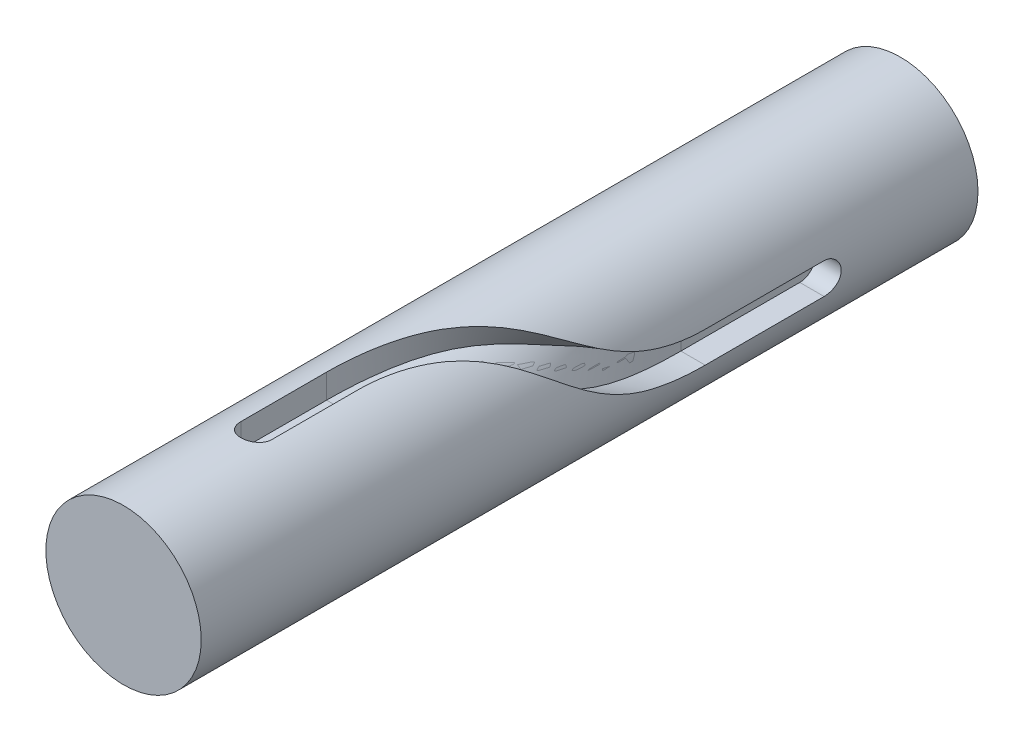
ISO-10303-21;
HEADER;
FILE_DESCRIPTION(('STEP AP214'),'2;1');
FILE_NAME('part.step','',(''),(''),'','','');
FILE_SCHEMA(('AUTOMOTIVE_DESIGN { 1 0 10303 214 1 1 1 1 }'));
ENDSEC;
DATA;
#1=APPLICATION_CONTEXT('core data for automotive mechanical design processes');
#2=APPLICATION_PROTOCOL_DEFINITION('international standard','automotive_design',2000,#1);
#3=PRODUCT_CONTEXT('',#1,'mechanical');
#4=PRODUCT('Part','Part','',(#3));
#5=PRODUCT_RELATED_PRODUCT_CATEGORY('part','',(#4));
#6=PRODUCT_DEFINITION_FORMATION('','',#4);
#7=PRODUCT_DEFINITION_CONTEXT('part definition',#1,'design');
#8=PRODUCT_DEFINITION('design','',#6,#7);
#9=PRODUCT_DEFINITION_SHAPE('','',#8);
#10=(LENGTH_UNIT() NAMED_UNIT(*) SI_UNIT(.MILLI.,.METRE.));
#11=(NAMED_UNIT(*) PLANE_ANGLE_UNIT() SI_UNIT($,.RADIAN.));
#12=(NAMED_UNIT(*) SI_UNIT($,.STERADIAN.) SOLID_ANGLE_UNIT());
#13=UNCERTAINTY_MEASURE_WITH_UNIT(LENGTH_MEASURE(1.E-05),#10,'distance_accuracy_value','');
#14=(GEOMETRIC_REPRESENTATION_CONTEXT(3) GLOBAL_UNCERTAINTY_ASSIGNED_CONTEXT((#13)) GLOBAL_UNIT_ASSIGNED_CONTEXT((#10,
#11,#12)) REPRESENTATION_CONTEXT('',''));
#15=CARTESIAN_POINT('',(0.,0.,0.));
#16=DIRECTION('',(0.,0.,1.));
#17=DIRECTION('',(1.,0.,0.));
#18=AXIS2_PLACEMENT_3D('',#15,#16,#17);
#19=CARTESIAN_POINT('',(0.,0.,-55.));
#20=DIRECTION('',(0.,0.,1.));
#21=DIRECTION('',(1.,0.,0.));
#22=AXIS2_PLACEMENT_3D('',#19,#20,#21);
#23=CYLINDRICAL_SURFACE('',#22,10.);
#24=CARTESIAN_POINT('',(0.,0.,-55.));
#25=DIRECTION('',(0.,0.,1.));
#26=DIRECTION('',(1.,0.,0.));
#27=AXIS2_PLACEMENT_3D('',#24,#25,#26);
#28=CIRCLE('',#27,10.);
#29=CARTESIAN_POINT('',(10.,0.,-55.));
#30=VERTEX_POINT('',#29);
#31=EDGE_CURVE('E69',#30,#30,#28,.T.);
#32=ORIENTED_EDGE('',*,*,#31,.T.);
#33=EDGE_LOOP('',(#32));
#34=FACE_BOUND('',#33,.T.);
#35=CARTESIAN_POINT('',(0.,0.,55.));
#36=DIRECTION('',(0.,0.,1.));
#37=DIRECTION('',(1.,0.,0.));
#38=AXIS2_PLACEMENT_3D('',#35,#36,#37);
#39=CIRCLE('',#38,10.);
#40=CARTESIAN_POINT('',(10.,0.,55.));
#41=VERTEX_POINT('',#40);
#42=EDGE_CURVE('E12',#41,#41,#39,.T.);
#43=ORIENTED_EDGE('',*,*,#42,.F.);
#44=EDGE_LOOP('',(#43));
#45=FACE_BOUND('',#44,.T.);
#46=ADVANCED_FACE('F68',(#34,#45),#23,.T.);
#47=OPEN_SHELL('',(#46));
#48=SHELL_BASED_SURFACE_MODEL('B2',(#47));
#49=CARTESIAN_POINT('',(0.,0.,92.5137154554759));
#50=DIRECTION('',(0.,0.,1.));
#51=DIRECTION('',(1.,0.,0.));
#52=AXIS2_PLACEMENT_3D('',#49,#50,#51);
#53=CYLINDRICAL_SURFACE('',#52,15.);
#54=CARTESIAN_POINT('',(0.,0.,-75.));
#55=DIRECTION('',(0.,0.,1.));
#56=DIRECTION('',(1.,0.,0.));
#57=AXIS2_PLACEMENT_3D('',#54,#55,#56);
#58=CIRCLE('',#57,15.);
#59=CARTESIAN_POINT('',(15.,0.,-75.));
#60=VERTEX_POINT('',#59);
#61=EDGE_CURVE('E393',#60,#60,#58,.T.);
#62=ORIENTED_EDGE('',*,*,#61,.T.);
#63=EDGE_LOOP('',(#62));
#64=FACE_BOUND('',#63,.T.);
#65=CARTESIAN_POINT('',(0.,0.,75.));
#66=DIRECTION('',(0.,0.,1.));
#67=DIRECTION('',(1.,0.,0.));
#68=AXIS2_PLACEMENT_3D('',#65,#66,#67);
#69=CIRCLE('',#68,15.);
#70=CARTESIAN_POINT('',(15.,0.,75.));
#71=VERTEX_POINT('',#70);
#72=EDGE_CURVE('E299',#71,#71,#69,.T.);
#73=ORIENTED_EDGE('',*,*,#72,.F.);
#74=EDGE_LOOP('',(#73));
#75=FACE_BOUND('',#74,.T.);
#76=DIRECTION('',(0.,0.,1.));
#77=VECTOR('',#76,1.);
#78=CARTESIAN_POINT('',(14.696938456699,3.,92.5137154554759));
#79=LINE('',#78,#77);
#80=CARTESIAN_POINT('',(14.696938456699,3.,-22.6282938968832));
#81=VERTEX_POINT('',#80);
#82=CARTESIAN_POINT('',(14.696938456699,3.,-45.587733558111));
#83=VERTEX_POINT('',#82);
#84=EDGE_CURVE('E392',#81,#83,#79,.F.);
#85=ORIENTED_EDGE('',*,*,#84,.T.);
#86=CARTESIAN_POINT('',(15.,0.,-42.5877335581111));
#87=CARTESIAN_POINT('',(14.9999969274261,0.166730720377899,-42.5877396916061));
#88=CARTESIAN_POINT('',(14.9971915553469,0.333538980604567,-42.601680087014));
#89=CARTESIAN_POINT('',(14.9862709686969,0.662440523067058,-42.6570290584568));
#90=CARTESIAN_POINT('',(14.9781515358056,0.824529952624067,-42.6984594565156));
#91=CARTESIAN_POINT('',(14.9575094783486,1.13919091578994,-42.8074573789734));
#92=CARTESIAN_POINT('',(14.9449910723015,1.2917714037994,-42.8749998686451));
#93=CARTESIAN_POINT('',(14.9169119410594,1.58342396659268,-43.0342303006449));
#94=CARTESIAN_POINT('',(14.9013513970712,1.72249684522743,-43.1259168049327));
#95=CARTESIAN_POINT('',(14.8686649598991,1.98508043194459,-43.3321490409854));
#96=CARTESIAN_POINT('',(14.8515223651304,2.10838185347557,-43.4469586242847));
#97=CARTESIAN_POINT('',(14.8177254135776,2.33411026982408,-43.6956108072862));
#98=CARTESIAN_POINT('',(14.8010710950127,2.43653563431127,-43.8294548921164));
#99=CARTESIAN_POINT('',(14.7699732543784,2.61849526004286,-44.1138821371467));
#100=CARTESIAN_POINT('',(14.7555512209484,2.6978128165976,-44.2646064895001));
#101=CARTESIAN_POINT('',(14.7307880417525,2.82991699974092,-44.5775790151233));
#102=CARTESIAN_POINT('',(14.7204464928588,2.88270624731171,-44.7398260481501));
#103=CARTESIAN_POINT('',(14.7051841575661,2.95957589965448,-45.0689866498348));
#104=CARTESIAN_POINT('',(14.7001941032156,2.98402349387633,-45.2358111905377));
#105=CARTESIAN_POINT('',(14.6959912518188,3.00465638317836,-45.5712630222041));
#106=CARTESIAN_POINT('',(14.6967778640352,3.0008445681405,-45.7398901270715));
#107=CARTESIAN_POINT('',(14.7039765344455,2.96536371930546,-46.0714739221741));
#108=CARTESIAN_POINT('',(14.7103035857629,2.93411562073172,-46.234477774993));
#109=CARTESIAN_POINT('',(14.7277363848,2.84531365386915,-46.5528817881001));
#110=CARTESIAN_POINT('',(14.7388423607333,2.78775852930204,-46.7082815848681));
#111=CARTESIAN_POINT('',(14.7646685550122,2.64757435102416,-47.0082793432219));
#112=CARTESIAN_POINT('',(14.7794126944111,2.56477845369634,-47.1527971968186));
#113=CARTESIAN_POINT('',(14.8108385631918,2.37658072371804,-47.4260461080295));
#114=CARTESIAN_POINT('',(14.827520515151,2.27117629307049,-47.5547753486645));
#115=CARTESIAN_POINT('',(14.8613106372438,2.03849980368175,-47.7952217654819));
#116=CARTESIAN_POINT('',(14.8784210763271,1.91086848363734,-47.9065912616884));
#117=CARTESIAN_POINT('',(14.9108654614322,1.63855507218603,-48.1063950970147));
#118=CARTESIAN_POINT('',(14.9261993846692,1.49387276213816,-48.1948291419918));
#119=CARTESIAN_POINT('',(14.9534007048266,1.19117816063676,-48.346316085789));
#120=CARTESIAN_POINT('',(14.9652626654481,1.0331454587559,-48.4093292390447));
#121=CARTESIAN_POINT('',(14.9841422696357,0.708446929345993,-48.5078149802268));
#122=CARTESIAN_POINT('',(14.9911605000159,0.541782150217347,-48.5432909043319));
#123=CARTESIAN_POINT('',(14.999480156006,0.207538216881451,-48.5852029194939));
#124=CARTESIAN_POINT('',(15.0008752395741,0.0400209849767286,-48.5921148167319));
#125=CARTESIAN_POINT('',(14.9980515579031,-0.293774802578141,-48.5779839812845));
#126=CARTESIAN_POINT('',(14.9938331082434,-0.460053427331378,-48.5569428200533));
#127=CARTESIAN_POINT('',(14.9803149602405,-0.785116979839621,-48.4878984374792));
#128=CARTESIAN_POINT('',(14.9710612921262,-0.943955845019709,-48.4401393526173));
#129=CARTESIAN_POINT('',(14.948506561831,-1.251370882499,-48.3192816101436));
#130=CARTESIAN_POINT('',(14.9352051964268,-1.39994628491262,-48.2461810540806));
#131=CARTESIAN_POINT('',(14.9057973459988,-1.68462352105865,-48.0756860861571));
#132=CARTESIAN_POINT('',(14.8896585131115,-1.82055038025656,-47.9780052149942));
#133=CARTESIAN_POINT('',(14.8564420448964,-2.07425405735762,-47.7615059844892));
#134=CARTESIAN_POINT('',(14.8393643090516,-2.19202892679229,-47.6426853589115));
#135=CARTESIAN_POINT('',(14.8058791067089,-2.40792177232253,-47.3851135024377));
#136=CARTESIAN_POINT('',(14.7894858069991,-2.50571310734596,-47.2460863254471));
#137=CARTESIAN_POINT('',(14.7595257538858,-2.67655626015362,-46.953299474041));
#138=CARTESIAN_POINT('',(14.7459588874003,-2.74960906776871,-46.7995403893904));
#139=CARTESIAN_POINT('',(14.7233022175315,-2.86845552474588,-46.4824288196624));
#140=CARTESIAN_POINT('',(14.7141892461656,-2.91439049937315,-46.3191310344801));
#141=CARTESIAN_POINT('',(14.7014231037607,-2.97812595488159,-45.9869331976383));
#142=CARTESIAN_POINT('',(14.6977692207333,-2.99593010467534,-45.818033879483));
#143=CARTESIAN_POINT('',(14.6963744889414,-3.00276273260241,-45.4827069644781));
#144=CARTESIAN_POINT('',(14.698527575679,-2.99230736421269,-45.31629011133));
#145=CARTESIAN_POINT('',(14.7082672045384,-2.94405691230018,-44.987638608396));
#146=CARTESIAN_POINT('',(14.7158537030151,-2.9062620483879,-44.8254039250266));
#147=CARTESIAN_POINT('',(14.7355579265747,-2.80463570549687,-44.5100504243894));
#148=CARTESIAN_POINT('',(14.7476646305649,-2.74086752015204,-44.3569104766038));
#149=CARTESIAN_POINT('',(14.7750514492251,-2.58916393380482,-44.0634223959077));
#150=CARTESIAN_POINT('',(14.7903318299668,-2.50122650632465,-43.9230753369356));
#151=CARTESIAN_POINT('',(14.8226688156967,-2.30191774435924,-43.6565868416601));
#152=CARTESIAN_POINT('',(14.839751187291,-2.19017366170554,-43.5307272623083));
#153=CARTESIAN_POINT('',(14.8735824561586,-1.94719310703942,-43.2993749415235));
#154=CARTESIAN_POINT('',(14.8903312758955,-1.81595216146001,-43.1938868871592));
#155=CARTESIAN_POINT('',(14.9218149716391,-1.53605288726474,-43.0052296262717));
#156=CARTESIAN_POINT('',(14.9365269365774,-1.38722665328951,-42.922305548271));
#157=CARTESIAN_POINT('',(14.96205375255,-1.0774990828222,-42.7827751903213));
#158=CARTESIAN_POINT('',(14.9728721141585,-0.916608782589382,-42.7261451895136));
#159=CARTESIAN_POINT('',(14.9872911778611,-0.629464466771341,-42.6517777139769));
#160=CARTESIAN_POINT('',(14.9920290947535,-0.504844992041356,-42.6278039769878));
#161=CARTESIAN_POINT('',(14.9983846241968,-0.253498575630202,-42.595779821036));
#162=CARTESIAN_POINT('',(15.0000023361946,-0.126771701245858,-42.5877288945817));
#163=CARTESIAN_POINT('',(15.,0.,-42.5877335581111));
#164=B_SPLINE_CURVE_WITH_KNOTS('',3,(#86,#87,#88,#89,#90,#91,#92,#93,#94,#95,#96,#97,#98,#99,
#100,#101,#102,#103,#104,#105,#106,#107,#108,#109,#110,#111,#112,#113,#114,#115,#116,#117,#118,
#119,#120,#121,#122,#123,#124,#125,#126,#127,#128,#129,#130,#131,#132,#133,#134,#135,#136,#137,
#138,#139,#140,#141,#142,#143,#144,#145,#146,#147,#148,#149,#150,#151,#152,#153,#154,#155,#156,
#157,#158,#159,#160,#161,#162,#163),.UNSPECIFIED.,.T.,.F.,(4,2,2,2,2,2,2,2,2,2,2,2,2,2,2,2,2,2,
2,2,2,2,2,2,2,2,2,2,2,2,2,2,2,2,2,2,2,2,4),(0.,0.499728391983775,0.999853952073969,
1.49950120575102,1.99911870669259,2.50479801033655,3.0105167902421,3.52083585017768,
4.03110448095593,4.53468555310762,5.03821512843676,5.53415181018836,6.0301121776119,
6.52942470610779,7.02879464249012,7.53714757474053,8.04550702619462,8.55465824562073,
9.06374777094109,9.56432207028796,10.064868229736,10.5609136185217,11.0569961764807,
11.5591519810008,12.0613616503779,12.5712188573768,13.081055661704,13.5882114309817,
14.0953010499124,14.593191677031,15.0910783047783,15.5877588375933,16.084481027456,
16.5896422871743,17.0949196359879,17.6054849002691,18.1155886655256,18.4955632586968,
18.8755257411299),.UNSPECIFIED.);
#165=CARTESIAN_POINT('',(14.696938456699,-3.,-45.587733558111));
#166=VERTEX_POINT('',#165);
#167=EDGE_CURVE('E105',#83,#166,#164,.T.);
#168=ORIENTED_EDGE('',*,*,#167,.T.);
#169=DIRECTION('',(0.,0.,1.));
#170=VECTOR('',#169,1.);
#171=CARTESIAN_POINT('',(14.696938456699,-3.,92.5137154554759));
#172=LINE('',#171,#170);
#173=CARTESIAN_POINT('',(14.696938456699,-3.,-22.6282938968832));
#174=VERTEX_POINT('',#173);
#175=EDGE_CURVE('E226',#174,#166,#172,.F.);
#176=ORIENTED_EDGE('',*,*,#175,.F.);
#177=CARTESIAN_POINT('',(14.696938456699,-3.,-22.6282938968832));
#178=CARTESIAN_POINT('',(14.6969280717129,-2.99998681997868,-22.2417505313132));
#179=CARTESIAN_POINT('',(14.6980614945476,-2.99449657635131,-21.855212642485));
#180=CARTESIAN_POINT('',(14.7024908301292,-2.97270738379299,-21.0822675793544));
#181=CARTESIAN_POINT('',(14.7057877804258,-2.95640324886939,-20.6958605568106));
#182=CARTESIAN_POINT('',(14.714420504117,-2.91312351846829,-19.9235173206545));
#183=CARTESIAN_POINT('',(14.7197570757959,-2.88614374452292,-19.5375813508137));
#184=CARTESIAN_POINT('',(14.7322727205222,-2.82156515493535,-18.7665213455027));
#185=CARTESIAN_POINT('',(14.7394523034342,-2.7839634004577,-18.3813975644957));
#186=CARTESIAN_POINT('',(14.7554038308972,-2.69814035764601,-17.6123082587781));
#187=CARTESIAN_POINT('',(14.7641760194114,-2.64991744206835,-17.2283429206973));
#188=CARTESIAN_POINT('',(14.7830011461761,-2.54280068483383,-16.4619199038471));
#189=CARTESIAN_POINT('',(14.793054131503,-2.48390645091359,-16.0794622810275));
#190=CARTESIAN_POINT('',(14.8140102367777,-2.35569473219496,-15.3184113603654));
#191=CARTESIAN_POINT('',(14.8249085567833,-2.28643428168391,-14.9398083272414));
#192=CARTESIAN_POINT('',(14.8471644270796,-2.13714852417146,-14.1847815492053));
#193=CARTESIAN_POINT('',(14.8585219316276,-2.05712428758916,-13.8083575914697));
#194=CARTESIAN_POINT('',(14.8811875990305,-1.88618359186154,-13.0580392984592));
#195=CARTESIAN_POINT('',(14.8924957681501,-1.79526855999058,-12.6841446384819));
#196=CARTESIAN_POINT('',(14.9144781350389,-1.60242282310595,-11.9392327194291));
#197=CARTESIAN_POINT('',(14.9251524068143,-1.5004934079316,-11.5682151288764));
#198=CARTESIAN_POINT('',(14.9452033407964,-1.28551583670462,-10.8293967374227));
#199=CARTESIAN_POINT('',(14.9545800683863,-1.17246824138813,-10.4615957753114));
#200=CARTESIAN_POINT('',(14.9712910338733,-0.935193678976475,-9.72954182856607));
#201=CARTESIAN_POINT('',(14.9786251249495,-0.810965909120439,-9.36528910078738));
#202=CARTESIAN_POINT('',(14.9915247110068,-0.527206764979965,-8.57332597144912));
#203=CARTESIAN_POINT('',(14.996507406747,-0.365406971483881,-8.14641589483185));
#204=CARTESIAN_POINT('',(15.0009350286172,-0.0263165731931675,-7.2987115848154));
#205=CARTESIAN_POINT('',(15.0003793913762,0.150975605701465,-6.87791797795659));
#206=CARTESIAN_POINT('',(14.9921035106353,0.520566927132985,-6.04306593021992));
#207=CARTESIAN_POINT('',(14.9843836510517,0.712865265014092,-5.62900712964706));
#208=CARTESIAN_POINT('',(14.9600807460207,1.11170371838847,-4.80812351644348));
#209=CARTESIAN_POINT('',(14.9434986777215,1.31824226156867,-4.40129791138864));
#210=CARTESIAN_POINT('',(14.8997538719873,1.7444815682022,-3.5952336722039));
#211=CARTESIAN_POINT('',(14.8725922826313,1.96418090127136,-3.19599421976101));
#212=CARTESIAN_POINT('',(14.806191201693,2.41415353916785,-2.40734459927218));
#213=CARTESIAN_POINT('',(14.7670162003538,2.6443649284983,-2.01789368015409));
#214=CARTESIAN_POINT('',(14.6750087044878,3.11472957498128,-1.2466126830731));
#215=CARTESIAN_POINT('',(14.6221743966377,3.35488414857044,-0.864783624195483));
#216=CARTESIAN_POINT('',(14.501517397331,3.84307224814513,-0.108583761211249));
#217=CARTESIAN_POINT('',(14.4336941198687,4.09110608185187,0.265786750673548));
#218=CARTESIAN_POINT('',(14.2820034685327,4.59271289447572,1.00746512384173));
#219=CARTESIAN_POINT('',(14.1981370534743,4.8462855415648,1.37477340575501));
#220=CARTESIAN_POINT('',(14.01365725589,5.35639360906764,2.10293790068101));
#221=CARTESIAN_POINT('',(13.9130476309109,5.61292835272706,2.46379554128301));
#222=CARTESIAN_POINT('',(13.6841247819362,6.15128861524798,3.21484995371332));
#223=CARTESIAN_POINT('',(13.5540696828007,6.43314981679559,3.60449102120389));
#224=CARTESIAN_POINT('',(13.2735518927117,6.99364133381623,4.37866609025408));
#225=CARTESIAN_POINT('',(13.1230905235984,7.2722718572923,4.76320042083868));
#226=CARTESIAN_POINT('',(12.802592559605,7.82272587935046,5.52896690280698));
#227=CARTESIAN_POINT('',(12.6325559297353,8.09454936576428,5.91019904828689));
#228=CARTESIAN_POINT('',(12.274431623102,8.62794958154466,6.67135126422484));
#229=CARTESIAN_POINT('',(12.0863438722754,8.88952626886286,7.05127132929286));
#230=CARTESIAN_POINT('',(11.6943334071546,9.39925138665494,7.81189627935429));
#231=CARTESIAN_POINT('',(11.4904120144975,9.64740093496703,8.19260109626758));
#232=CARTESIAN_POINT('',(11.0695477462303,10.1275381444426,8.9570126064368));
#233=CARTESIAN_POINT('',(10.8526046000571,10.3595254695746,9.34071936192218));
#234=CARTESIAN_POINT('',(10.4091109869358,10.8050546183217,10.1132118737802));
#235=CARTESIAN_POINT('',(10.182561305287,11.0185979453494,10.5019972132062));
#236=CARTESIAN_POINT('',(9.72368306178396,11.4255869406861,11.2866052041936));
#237=CARTESIAN_POINT('',(9.49135475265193,11.6190334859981,11.6824275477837));
#238=CARTESIAN_POINT('',(9.04961874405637,11.9655645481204,12.4405684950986));
#239=CARTESIAN_POINT('',(8.8403759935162,12.1207541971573,12.8020215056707));
#240=CARTESIAN_POINT('',(8.4235702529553,12.4140406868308,13.5327859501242));
#241=CARTESIAN_POINT('',(8.21600734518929,12.552136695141,13.9020977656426));
#242=CARTESIAN_POINT('',(7.80553847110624,12.8114212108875,14.6491022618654));
#243=CARTESIAN_POINT('',(7.60263203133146,12.9326114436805,15.026794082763));
#244=CARTESIAN_POINT('',(7.20421208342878,13.1587159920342,15.7907979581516));
#245=CARTESIAN_POINT('',(7.00869775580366,13.2636321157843,16.1771090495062));
#246=CARTESIAN_POINT('',(6.62686277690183,13.4584839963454,16.9595119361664));
#247=CARTESIAN_POINT('',(6.44057222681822,13.5483727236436,17.35563014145));
#248=CARTESIAN_POINT('',(6.07982230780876,13.7140505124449,18.1561924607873));
#249=CARTESIAN_POINT('',(5.90536479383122,13.7898373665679,18.5606378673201));
#250=CARTESIAN_POINT('',(5.56986405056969,13.9287326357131,19.3772393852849));
#251=CARTESIAN_POINT('',(5.40882216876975,13.9918397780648,19.7893962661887));
#252=CARTESIAN_POINT('',(5.10130354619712,14.1068658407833,20.620626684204));
#253=CARTESIAN_POINT('',(4.95482627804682,14.158785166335,21.0396999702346));
#254=CARTESIAN_POINT('',(4.69694549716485,14.2462098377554,21.8238046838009));
#255=CARTESIAN_POINT('',(4.58351804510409,14.2829998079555,22.1880305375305));
#256=CARTESIAN_POINT('',(4.36818501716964,14.3503201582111,22.9204442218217));
#257=CARTESIAN_POINT('',(4.2662794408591,14.380850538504,23.2886320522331));
#258=CARTESIAN_POINT('',(4.07413529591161,14.4364616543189,24.0284938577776));
#259=CARTESIAN_POINT('',(3.98389824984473,14.4615416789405,24.4001682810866));
#260=CARTESIAN_POINT('',(3.81516339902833,14.5069694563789,25.1465229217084));
#261=CARTESIAN_POINT('',(3.73666759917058,14.527316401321,25.5212036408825));
#262=CARTESIAN_POINT('',(3.59145226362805,14.5638963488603,26.273087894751));
#263=CARTESIAN_POINT('',(3.52473427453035,14.5801288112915,26.6502917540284));
#264=CARTESIAN_POINT('',(3.40275041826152,14.6090807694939,27.4089512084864));
#265=CARTESIAN_POINT('',(3.34755398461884,14.6217791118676,27.7904187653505));
#266=CARTESIAN_POINT('',(3.2491554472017,14.6439589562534,28.554957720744));
#267=CARTESIAN_POINT('',(3.20595234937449,14.6534407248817,28.9380289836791));
#268=CARTESIAN_POINT('',(3.13163801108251,14.6695016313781,29.7052989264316));
#269=CARTESIAN_POINT('',(3.10052351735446,14.6760815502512,30.0894972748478));
#270=CARTESIAN_POINT('',(3.05053801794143,14.6865552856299,30.858553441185));
#271=CARTESIAN_POINT('',(3.03166145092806,14.6904503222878,31.2434108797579));
#272=CARTESIAN_POINT('',(3.0064047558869,14.6956306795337,32.0133195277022));
#273=CARTESIAN_POINT('',(3.00001710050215,14.6969175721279,32.3983704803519));
#274=CARTESIAN_POINT('',(3.,14.696938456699,32.7834306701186));
#275=B_SPLINE_CURVE_WITH_KNOTS('',3,(#177,#178,#179,#180,#181,#182,#183,#184,#185,#186,#187,
#188,#189,#190,#191,#192,#193,#194,#195,#196,#197,#198,#199,#200,#201,#202,#203,#204,#205,#206,
#207,#208,#209,#210,#211,#212,#213,#214,#215,#216,#217,#218,#219,#220,#221,#222,#223,#224,#225,
#226,#227,#228,#229,#230,#231,#232,#233,#234,#235,#236,#237,#238,#239,#240,#241,#242,#243,#244,
#245,#246,#247,#248,#249,#250,#251,#252,#253,#254,#255,#256,#257,#258,#259,#260,#261,#262,#263,
#264,#265,#266,#267,#268,#269,#270,#271,#272,#273,#274),.UNSPECIFIED.,.F.,.F.,(4,2,2,2,2,2,2,2,
2,2,2,2,2,2,2,2,2,2,2,2,2,2,2,2,2,2,2,2,2,2,2,2,2,2,2,2,2,2,2,2,2,2,2,2,2,2,2,2,4),(0.,
1.15958178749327,2.31972007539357,3.4803128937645,4.64122713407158,5.80231935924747,
6.9634542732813,8.11842080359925,9.27327256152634,10.4279731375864,11.5825386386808,
12.7370459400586,13.8916362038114,15.2610085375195,16.6305201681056,17.9999584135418,
19.3692456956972,20.7383844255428,22.1002983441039,23.4623931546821,24.8245412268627,
26.1866079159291,27.5483693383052,29.0424319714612,30.5363978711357,32.0303664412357,
33.5243411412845,35.0181912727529,36.5120724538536,38.0058317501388,39.4995258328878,
40.8357955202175,42.1721302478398,43.5083284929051,44.8443781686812,46.1845338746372,
47.5248991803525,48.8653989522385,50.2058501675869,51.3553540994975,52.5048579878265,
53.6545117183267,54.8043615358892,55.9543622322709,57.1111050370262,58.2677519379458,
59.4240873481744,60.579896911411,61.7350096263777),.UNSPECIFIED.);
#276=CARTESIAN_POINT('',(3.,14.696938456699,32.7834306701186));
#277=VERTEX_POINT('',#276);
#278=EDGE_CURVE('E98',#174,#277,#275,.T.);
#279=ORIENTED_EDGE('',*,*,#278,.T.);
#280=DIRECTION('',(0.,0.,1.));
#281=VECTOR('',#280,1.);
#282=CARTESIAN_POINT('',(3.,14.696938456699,92.5137154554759));
#283=LINE('',#282,#281);
#284=CARTESIAN_POINT('',(3.,14.696938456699,49.3407188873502));
#285=VERTEX_POINT('',#284);
#286=EDGE_CURVE('E66',#285,#277,#283,.F.);
#287=ORIENTED_EDGE('',*,*,#286,.F.);
#288=CARTESIAN_POINT('',(0.,15.,46.3407188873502));
#289=CARTESIAN_POINT('',(0.166730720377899,14.9999969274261,46.3407250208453));
#290=CARTESIAN_POINT('',(0.333538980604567,14.9971915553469,46.3546654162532));
#291=CARTESIAN_POINT('',(0.662440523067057,14.9862709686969,46.410014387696));
#292=CARTESIAN_POINT('',(0.824529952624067,14.9781515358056,46.4514447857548));
#293=CARTESIAN_POINT('',(1.13919091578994,14.9575094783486,46.5604427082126));
#294=CARTESIAN_POINT('',(1.2917714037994,14.9449910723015,46.6279851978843));
#295=CARTESIAN_POINT('',(1.58342396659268,14.9169119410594,46.7872156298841));
#296=CARTESIAN_POINT('',(1.72249684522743,14.9013513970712,46.8789021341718));
#297=CARTESIAN_POINT('',(1.98508043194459,14.8686649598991,47.0851343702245));
#298=CARTESIAN_POINT('',(2.10838185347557,14.8515223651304,47.1999439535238));
#299=CARTESIAN_POINT('',(2.33411026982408,14.8177254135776,47.4485961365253));
#300=CARTESIAN_POINT('',(2.43653563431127,14.8010710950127,47.5824402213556));
#301=CARTESIAN_POINT('',(2.61849526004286,14.7699732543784,47.8668674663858));
#302=CARTESIAN_POINT('',(2.6978128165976,14.7555512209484,48.0175918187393));
#303=CARTESIAN_POINT('',(2.82991699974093,14.7307880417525,48.3305643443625));
#304=CARTESIAN_POINT('',(2.88270624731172,14.7204464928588,48.4928113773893));
#305=CARTESIAN_POINT('',(2.95957589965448,14.7051841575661,48.821971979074));
#306=CARTESIAN_POINT('',(2.98402349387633,14.7001941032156,48.9887965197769));
#307=CARTESIAN_POINT('',(3.00465638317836,14.6959912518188,49.3242483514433));
#308=CARTESIAN_POINT('',(3.0008445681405,14.6967778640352,49.4928754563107));
#309=CARTESIAN_POINT('',(2.96536371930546,14.7039765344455,49.8244592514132));
#310=CARTESIAN_POINT('',(2.93411562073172,14.7103035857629,49.9874631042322));
#311=CARTESIAN_POINT('',(2.84531365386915,14.7277363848,50.3058671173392));
#312=CARTESIAN_POINT('',(2.78775852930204,14.7388423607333,50.4612669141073));
#313=CARTESIAN_POINT('',(2.64757435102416,14.7646685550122,50.761264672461));
#314=CARTESIAN_POINT('',(2.56477845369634,14.7794126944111,50.9057825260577));
#315=CARTESIAN_POINT('',(2.37658072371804,14.8108385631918,51.1790314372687));
#316=CARTESIAN_POINT('',(2.27117629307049,14.827520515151,51.3077606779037));
#317=CARTESIAN_POINT('',(2.03849980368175,14.8613106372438,51.548207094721));
#318=CARTESIAN_POINT('',(1.91086848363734,14.8784210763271,51.6595765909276));
#319=CARTESIAN_POINT('',(1.63855507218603,14.9108654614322,51.8593804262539));
#320=CARTESIAN_POINT('',(1.49387276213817,14.9261993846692,51.947814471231));
#321=CARTESIAN_POINT('',(1.19117816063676,14.9534007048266,52.0993014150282));
#322=CARTESIAN_POINT('',(1.0331454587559,14.9652626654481,52.1623145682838));
#323=CARTESIAN_POINT('',(0.708446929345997,14.9841422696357,52.2608003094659));
#324=CARTESIAN_POINT('',(0.541782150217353,14.9911605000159,52.2962762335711));
#325=CARTESIAN_POINT('',(0.207538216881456,14.999480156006,52.3381882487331));
#326=CARTESIAN_POINT('',(0.0400209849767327,15.0008752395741,52.345100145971));
#327=CARTESIAN_POINT('',(-0.29377480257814,14.9980515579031,52.3309693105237));
#328=CARTESIAN_POINT('',(-0.460053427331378,14.9938331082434,52.3099281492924));
#329=CARTESIAN_POINT('',(-0.785116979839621,14.9803149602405,52.2408837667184));
#330=CARTESIAN_POINT('',(-0.943955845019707,14.9710612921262,52.1931246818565));
#331=CARTESIAN_POINT('',(-1.251370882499,14.948506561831,52.0722669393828));
#332=CARTESIAN_POINT('',(-1.39994628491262,14.9352051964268,51.9991663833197));
#333=CARTESIAN_POINT('',(-1.68462352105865,14.9057973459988,51.8286714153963));
#334=CARTESIAN_POINT('',(-1.82055038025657,14.8896585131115,51.7309905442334));
#335=CARTESIAN_POINT('',(-2.07425405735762,14.8564420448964,51.5144913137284));
#336=CARTESIAN_POINT('',(-2.19202892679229,14.8393643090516,51.3956706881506));
#337=CARTESIAN_POINT('',(-2.40792177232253,14.8058791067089,51.1380988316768));
#338=CARTESIAN_POINT('',(-2.50571310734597,14.7894858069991,50.9990716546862));
#339=CARTESIAN_POINT('',(-2.67655626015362,14.7595257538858,50.7062848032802));
#340=CARTESIAN_POINT('',(-2.74960906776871,14.7459588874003,50.5525257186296));
#341=CARTESIAN_POINT('',(-2.86845552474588,14.7233022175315,50.2354141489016));
#342=CARTESIAN_POINT('',(-2.91439049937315,14.7141892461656,50.0721163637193));
#343=CARTESIAN_POINT('',(-2.97812595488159,14.7014231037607,49.7399185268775));
#344=CARTESIAN_POINT('',(-2.99593010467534,14.6977692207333,49.5710192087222));
#345=CARTESIAN_POINT('',(-3.00276273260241,14.6963744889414,49.2356922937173));
#346=CARTESIAN_POINT('',(-2.99230736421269,14.698527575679,49.0692754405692));
#347=CARTESIAN_POINT('',(-2.94405691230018,14.7082672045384,48.7406239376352));
#348=CARTESIAN_POINT('',(-2.9062620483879,14.715853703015,48.5783892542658));
#349=CARTESIAN_POINT('',(-2.80463570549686,14.7355579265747,48.2630357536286));
#350=CARTESIAN_POINT('',(-2.74086752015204,14.7476646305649,48.109895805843));
#351=CARTESIAN_POINT('',(-2.58916393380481,14.7750514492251,47.8164077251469));
#352=CARTESIAN_POINT('',(-2.50122650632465,14.7903318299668,47.6760606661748));
#353=CARTESIAN_POINT('',(-2.30191774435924,14.8226688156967,47.4095721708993));
#354=CARTESIAN_POINT('',(-2.19017366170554,14.839751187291,47.2837125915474));
#355=CARTESIAN_POINT('',(-1.94719310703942,14.8735824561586,47.0523602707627));
#356=CARTESIAN_POINT('',(-1.81595216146,14.8903312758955,46.9468722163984));
#357=CARTESIAN_POINT('',(-1.53605288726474,14.9218149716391,46.7582149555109));
#358=CARTESIAN_POINT('',(-1.38722665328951,14.9365269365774,46.6752908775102));
#359=CARTESIAN_POINT('',(-1.0774990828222,14.96205375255,46.5357605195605));
#360=CARTESIAN_POINT('',(-0.916608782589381,14.9728721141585,46.4791305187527));
#361=CARTESIAN_POINT('',(-0.629464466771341,14.9872911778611,46.4047630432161));
#362=CARTESIAN_POINT('',(-0.504844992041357,14.9920290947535,46.380789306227));
#363=CARTESIAN_POINT('',(-0.253498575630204,14.9983846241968,46.3487651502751));
#364=CARTESIAN_POINT('',(-0.126771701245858,15.0000023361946,46.3407142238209));
#365=CARTESIAN_POINT('',(0.,15.,46.3407188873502));
#366=B_SPLINE_CURVE_WITH_KNOTS('',3,(#288,#289,#290,#291,#292,#293,#294,#295,#296,#297,#298,
#299,#300,#301,#302,#303,#304,#305,#306,#307,#308,#309,#310,#311,#312,#313,#314,#315,#316,#317,
#318,#319,#320,#321,#322,#323,#324,#325,#326,#327,#328,#329,#330,#331,#332,#333,#334,#335,#336,
#337,#338,#339,#340,#341,#342,#343,#344,#345,#346,#347,#348,#349,#350,#351,#352,#353,#354,#355,
#356,#357,#358,#359,#360,#361,#362,#363,#364,#365),.UNSPECIFIED.,.T.,.F.,(4,2,2,2,2,2,2,2,2,2,2,
2,2,2,2,2,2,2,2,2,2,2,2,2,2,2,2,2,2,2,2,2,2,2,2,2,2,2,4),(0.,0.499728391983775,
0.999853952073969,1.49950120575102,1.99911870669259,2.50479801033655,3.0105167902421,
3.52083585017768,4.03110448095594,4.53468555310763,5.03821512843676,5.53415181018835,
6.03011217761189,6.52942470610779,7.02879464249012,7.53714757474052,8.04550702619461,
8.55465824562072,9.06374777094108,9.56432207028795,10.064868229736,10.5609136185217,
11.0569961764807,11.5591519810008,12.0613616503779,12.5712188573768,13.081055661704,
13.5882114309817,14.0953010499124,14.593191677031,15.0910783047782,15.5877588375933,
16.084481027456,16.5896422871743,17.0949196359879,17.6054849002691,18.1155886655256,
18.4955632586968,18.8755257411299),.UNSPECIFIED.);
#367=CARTESIAN_POINT('',(-3.,14.696938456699,49.3407188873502));
#368=VERTEX_POINT('',#367);
#369=EDGE_CURVE('E175',#285,#368,#366,.T.);
#370=ORIENTED_EDGE('',*,*,#369,.T.);
#371=DIRECTION('',(0.,0.,1.));
#372=VECTOR('',#371,1.);
#373=CARTESIAN_POINT('',(-3.,14.696938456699,92.5137154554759));
#374=LINE('',#373,#372);
#375=CARTESIAN_POINT('',(-3.,14.696938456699,32.7834306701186));
#376=VERTEX_POINT('',#375);
#377=EDGE_CURVE('E388',#368,#376,#374,.F.);
#378=ORIENTED_EDGE('',*,*,#377,.T.);
#379=CARTESIAN_POINT('',(14.696938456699,3.,-22.6282938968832));
#380=CARTESIAN_POINT('',(14.6969148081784,3.00001935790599,-22.230904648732));
#381=CARTESIAN_POINT('',(14.6955455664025,3.00682147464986,-21.8335256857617));
#382=CARTESIAN_POINT('',(14.690028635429,3.03371070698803,-21.0389646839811));
#383=CARTESIAN_POINT('',(14.6858790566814,3.0538068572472,-20.6417829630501));
#384=CARTESIAN_POINT('',(14.6747111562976,3.10701632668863,-19.8481333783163));
#385=CARTESIAN_POINT('',(14.6676913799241,3.14013624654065,-19.4516659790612));
#386=CARTESIAN_POINT('',(14.6505340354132,3.21923939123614,-18.6599653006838));
#387=CARTESIAN_POINT('',(14.6403955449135,3.26522642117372,-18.2647324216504));
#388=CARTESIAN_POINT('',(14.6166409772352,3.36996867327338,-17.4760309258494));
#389=CARTESIAN_POINT('',(14.6030245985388,3.42872500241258,-17.0825624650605));
#390=CARTESIAN_POINT('',(14.5719892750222,3.55830340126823,-16.3018620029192));
#391=CARTESIAN_POINT('',(14.5546101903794,3.62899740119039,-15.9146071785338));
#392=CARTESIAN_POINT('',(14.5153903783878,3.78282200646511,-15.1428590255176));
#393=CARTESIAN_POINT('',(14.4935503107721,3.8659507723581,-14.7583652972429));
#394=CARTESIAN_POINT('',(14.4447149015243,4.0445995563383,-13.9926679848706));
#395=CARTESIAN_POINT('',(14.417720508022,4.14011729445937,-13.6114638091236));
#396=CARTESIAN_POINT('',(14.3577746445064,4.34344791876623,-12.8528702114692));
#397=CARTESIAN_POINT('',(14.324823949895,4.45125920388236,-12.4754802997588));
#398=CARTESIAN_POINT('',(14.2520642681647,4.67899050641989,-11.7250250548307));
#399=CARTESIAN_POINT('',(14.2122551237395,4.79891080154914,-11.3519598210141));
#400=CARTESIAN_POINT('',(14.1253758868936,5.04886416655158,-10.6155715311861));
#401=CARTESIAN_POINT('',(14.0784072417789,5.17874498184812,-10.2521848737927));
#402=CARTESIAN_POINT('',(13.9758560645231,5.44943973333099,-9.53068644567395));
#403=CARTESIAN_POINT('',(13.9202725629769,5.59025489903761,-9.1725752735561));
#404=CARTESIAN_POINT('',(13.7995112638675,5.88204149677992,-8.46216700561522));
#405=CARTESIAN_POINT('',(13.7343337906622,6.03301258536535,-8.10986971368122));
#406=CARTESIAN_POINT('',(13.5934440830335,6.34408547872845,-7.41151602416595));
#407=CARTESIAN_POINT('',(13.5177330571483,6.50418623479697,-7.06545891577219));
#408=CARTESIAN_POINT('',(13.3549287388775,6.83223187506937,-6.37988476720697));
#409=CARTESIAN_POINT('',(13.2678375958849,7.0001752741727,-6.0403665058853));
#410=CARTESIAN_POINT('',(13.0817452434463,7.34205204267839,-5.3686410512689));
#411=CARTESIAN_POINT('',(12.9827698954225,7.51597183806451,-5.03641977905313));
#412=CARTESIAN_POINT('',(12.7722266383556,7.86844084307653,-4.37845004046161));
#413=CARTESIAN_POINT('',(12.6606576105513,8.04699046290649,-4.05270215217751));
#414=CARTESIAN_POINT('',(12.4246178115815,8.4068527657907,-3.40741989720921));
#415=CARTESIAN_POINT('',(12.3001455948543,8.58816575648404,-3.08788623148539));
#416=CARTESIAN_POINT('',(12.0382467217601,8.95157937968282,-2.45461008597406));
#417=CARTESIAN_POINT('',(11.9008194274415,9.13368005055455,-2.14086789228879));
#418=CARTESIAN_POINT('',(11.6132412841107,9.49664331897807,-1.51861743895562));
#419=CARTESIAN_POINT('',(11.4630922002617,9.6775060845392,-1.21010846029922));
#420=CARTESIAN_POINT('',(11.1278553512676,10.062054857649,-0.553113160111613));
#421=CARTESIAN_POINT('',(10.9408577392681,10.2652497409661,-0.205312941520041));
#422=CARTESIAN_POINT('',(10.5518703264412,10.6646962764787,0.485784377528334));
#423=CARTESIAN_POINT('',(10.3498822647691,10.860948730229,0.829081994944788));
#424=CARTESIAN_POINT('',(9.93238168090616,11.2440228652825,1.51267764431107));
#425=CARTESIAN_POINT('',(9.71686965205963,11.4308448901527,1.85297578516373));
#426=CARTESIAN_POINT('',(9.27413977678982,11.7928835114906,2.53210815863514));
#427=CARTESIAN_POINT('',(9.0469222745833,11.968100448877,2.8709424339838));
#428=CARTESIAN_POINT('',(8.58286332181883,12.3051494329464,3.54871085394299));
#429=CARTESIAN_POINT('',(8.34602133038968,12.4669807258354,3.88764500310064));
#430=CARTESIAN_POINT('',(7.86503662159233,12.7758717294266,4.56708600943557));
#431=CARTESIAN_POINT('',(7.62089360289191,12.9229308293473,4.90759293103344));
#432=CARTESIAN_POINT('',(7.12778091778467,13.201322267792,5.59155328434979));
#433=CARTESIAN_POINT('',(6.8788110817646,13.3326540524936,5.9350068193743));
#434=CARTESIAN_POINT('',(6.37859336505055,13.5790762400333,6.62609863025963));
#435=CARTESIAN_POINT('',(6.12734530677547,13.6941653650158,6.97373723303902));
#436=CARTESIAN_POINT('',(5.5781490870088,13.9279995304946,7.73980588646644));
#437=CARTESIAN_POINT('',(5.28026204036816,14.0433968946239,8.15930716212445));
#438=CARTESIAN_POINT('',(4.68905151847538,14.2517049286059,9.0071371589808));
#439=CARTESIAN_POINT('',(4.39572890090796,14.3446114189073,9.43546750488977));
#440=CARTESIAN_POINT('',(3.81758680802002,14.5091828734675,10.301860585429));
#441=CARTESIAN_POINT('',(3.53276756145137,14.5808472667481,10.7399235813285));
#442=CARTESIAN_POINT('',(2.97513041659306,14.7047680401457,11.6262695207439));
#443=CARTESIAN_POINT('',(2.70231166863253,14.7570257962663,12.0745517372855));
#444=CARTESIAN_POINT('',(2.17104129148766,14.8445017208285,12.9824253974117));
#445=CARTESIAN_POINT('',(1.91262038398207,14.8796846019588,13.4420382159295));
#446=CARTESIAN_POINT('',(1.41307930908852,14.935407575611,14.3714930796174));
#447=CARTESIAN_POINT('',(1.17196084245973,14.9559462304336,14.8413361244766));
#448=CARTESIAN_POINT('',(0.70877723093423,14.9850428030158,15.7907015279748));
#449=CARTESIAN_POINT('',(0.486712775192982,14.9936002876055,16.2702242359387));
#450=CARTESIAN_POINT('',(0.062825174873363,15.0013660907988,17.2381124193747));
#451=CARTESIAN_POINT('',(-0.139000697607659,15.0005756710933,17.7264766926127));
#452=CARTESIAN_POINT('',(-0.568709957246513,14.9911127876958,18.8319159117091));
#453=CARTESIAN_POINT('',(-0.790862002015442,14.9805565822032,19.451209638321));
#454=CARTESIAN_POINT('',(-1.20247721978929,14.9531468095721,20.7003872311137));
#455=CARTESIAN_POINT('',(-1.39194047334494,14.9362932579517,21.3302710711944));
#456=CARTESIAN_POINT('',(-1.73853034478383,14.8999288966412,22.598871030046));
#457=CARTESIAN_POINT('',(-1.89565259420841,14.8804177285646,23.2375883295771));
#458=CARTESIAN_POINT('',(-2.17812774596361,14.8417005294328,24.521861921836));
#459=CARTESIAN_POINT('',(-2.30348734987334,14.8224944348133,25.1674167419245));
#460=CARTESIAN_POINT('',(-2.52310988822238,14.7866926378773,26.4637518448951));
#461=CARTESIAN_POINT('',(-2.61737724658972,14.7700965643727,27.1145313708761));
#462=CARTESIAN_POINT('',(-2.77522789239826,14.7412539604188,28.4196649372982));
#463=CARTESIAN_POINT('',(-2.83882344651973,14.7290056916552,29.0740174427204));
#464=CARTESIAN_POINT('',(-2.90581145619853,14.7158615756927,29.983787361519));
#465=CARTESIAN_POINT('',(-2.92222871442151,14.7126055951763,30.2382655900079));
#466=CARTESIAN_POINT('',(-2.95042116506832,14.7069794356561,30.7474554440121));
#467=CARTESIAN_POINT('',(-2.96219703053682,14.7046091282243,31.0021670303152));
#468=CARTESIAN_POINT('',(-2.99046548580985,14.6988907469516,31.7655322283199));
#469=CARTESIAN_POINT('',(-2.99997625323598,14.6969197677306,32.2744634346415));
#470=CARTESIAN_POINT('',(-3.,14.696938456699,32.7834306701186));
#471=B_SPLINE_CURVE_WITH_KNOTS('',3,(#379,#380,#381,#382,#383,#384,#385,#386,#387,#388,#389,
#390,#391,#392,#393,#394,#395,#396,#397,#398,#399,#400,#401,#402,#403,#404,#405,#406,#407,#408,
#409,#410,#411,#412,#413,#414,#415,#416,#417,#418,#419,#420,#421,#422,#423,#424,#425,#426,#427,
#428,#429,#430,#431,#432,#433,#434,#435,#436,#437,#438,#439,#440,#441,#442,#443,#444,#445,#446,
#447,#448,#449,#450,#451,#452,#453,#454,#455,#456,#457,#458,#459,#460,#461,#462,#463,#464,#465,
#466,#467,#468,#469,#470),.UNSPECIFIED.,.F.,.F.,(4,2,2,2,2,2,2,2,2,2,2,2,2,2,2,2,2,2,2,2,2,2,2,
2,2,2,2,2,2,2,2,2,2,2,2,2,2,2,2,2,2,2,2,2,2,4),(0.,1.19209304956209,2.38499708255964,
3.57850648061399,4.77236919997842,5.96633545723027,7.14822354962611,8.32993697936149,
9.51143324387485,10.692775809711,11.8741454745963,13.0401107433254,14.2062073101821,
15.3722644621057,16.5381879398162,17.7038915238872,18.8671028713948,20.0304176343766,
21.1938628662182,22.3573654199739,23.520706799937,24.8526484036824,26.1844357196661,
27.5161744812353,28.8478741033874,30.1796486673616,31.5114782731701,32.8433547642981,
34.1753359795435,35.7566268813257,37.3382114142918,38.9198384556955,40.5013533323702,
42.0861228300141,43.6710478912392,45.2560302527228,46.8407986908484,48.8138535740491,
50.7869035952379,52.7602199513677,54.7331196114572,56.7057384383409,58.6775676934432,
59.4426195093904,60.2075603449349,61.7342937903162),.UNSPECIFIED.);
#472=EDGE_CURVE('E237',#81,#376,#471,.T.);
#473=ORIENTED_EDGE('',*,*,#472,.F.);
#474=EDGE_LOOP('',(#85,#168,#176,#279,#287,#370,#378,#473));
#475=FACE_BOUND('',#474,.T.);
#476=ADVANCED_FACE('F90',(#64,#75,#475),#53,.T.);
#477=CARTESIAN_POINT('',(0.,0.,-75.));
#478=DIRECTION('',(0.,0.,-1.));
#479=DIRECTION('',(-1.,0.,0.));
#480=AXIS2_PLACEMENT_3D('',#477,#478,#479);
#481=PLANE('',#480);
#482=ORIENTED_EDGE('',*,*,#61,.F.);
#483=EDGE_LOOP('',(#482));
#484=FACE_BOUND('',#483,.T.);
#485=ADVANCED_FACE('F92',(#484),#481,.T.);
#486=CARTESIAN_POINT('',(0.,0.,75.));
#487=DIRECTION('',(0.,0.,1.));
#488=DIRECTION('',(1.,0.,0.));
#489=AXIS2_PLACEMENT_3D('',#486,#487,#488);
#490=PLANE('',#489);
#491=ORIENTED_EDGE('',*,*,#72,.T.);
#492=EDGE_LOOP('',(#491));
#493=FACE_BOUND('',#492,.T.);
#494=ADVANCED_FACE('F232',(#493),#490,.T.);
#495=CARTESIAN_POINT('',(10.,0.,-55.));
#496=DIRECTION('',(1.,0.,0.));
#497=DIRECTION('',(0.,0.,1.));
#498=AXIS2_PLACEMENT_3D('',#495,#496,#497);
#499=PLANE('',#498);
#500=CARTESIAN_POINT('',(10.,0.,-45.5877335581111));
#501=DIRECTION('',(1.,0.,0.));
#502=DIRECTION('',(0.,0.,-1.));
#503=AXIS2_PLACEMENT_3D('',#500,#501,#502);
#504=CIRCLE('',#503,3.);
#505=CARTESIAN_POINT('',(10.,-3.,-45.5877335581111));
#506=VERTEX_POINT('',#505);
#507=CARTESIAN_POINT('',(10.,3.,-45.5877335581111));
#508=VERTEX_POINT('',#507);
#509=EDGE_CURVE('E155',#506,#508,#504,.T.);
#510=ORIENTED_EDGE('',*,*,#509,.T.);
#511=DIRECTION('',(0.,0.,-1.));
#512=VECTOR('',#511,1.);
#513=CARTESIAN_POINT('',(9.99999999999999,3.,-22.6282938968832));
#514=LINE('',#513,#512);
#515=CARTESIAN_POINT('',(9.99999999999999,3.,-22.6282938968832));
#516=VERTEX_POINT('',#515);
#517=EDGE_CURVE('E161',#508,#516,#514,.F.);
#518=ORIENTED_EDGE('',*,*,#517,.T.);
#519=CARTESIAN_POINT('',(10.,-3.,-22.6282938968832));
#520=CARTESIAN_POINT('',(10.,3.,-22.6282938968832));
#521=B_SPLINE_CURVE_WITH_KNOTS('',1,(#519,#520),.UNSPECIFIED.,.F.,.F.,(2,2),(0.,1.),.UNSPECIFIED.);
#522=CARTESIAN_POINT('',(9.99999999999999,-3.,-22.6282938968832));
#523=VERTEX_POINT('',#522);
#524=EDGE_CURVE('E353',#516,#523,#521,.F.);
#525=ORIENTED_EDGE('',*,*,#524,.T.);
#526=DIRECTION('',(0.,0.,-1.));
#527=VECTOR('',#526,1.);
#528=CARTESIAN_POINT('',(9.99999999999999,-3.,-22.6282938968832));
#529=LINE('',#528,#527);
#530=EDGE_CURVE('E169',#506,#523,#529,.F.);
#531=ORIENTED_EDGE('',*,*,#530,.F.);
#532=EDGE_LOOP('',(#510,#518,#525,#531));
#533=FACE_BOUND('',#532,.T.);
#534=ADVANCED_FACE('F165',(#533),#499,.T.);
#535=CARTESIAN_POINT('',(0.,10.,-55.));
#536=DIRECTION('',(0.,1.,0.));
#537=DIRECTION('',(0.,0.,1.));
#538=AXIS2_PLACEMENT_3D('',#535,#536,#537);
#539=PLANE('',#538);
#540=DIRECTION('',(0.,0.,-1.));
#541=VECTOR('',#540,1.);
#542=CARTESIAN_POINT('',(-3.,10.,49.3407188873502));
#543=LINE('',#542,#541);
#544=CARTESIAN_POINT('',(-3.,10.,32.7834306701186));
#545=VERTEX_POINT('',#544);
#546=CARTESIAN_POINT('',(-3.,10.,49.3407188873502));
#547=VERTEX_POINT('',#546);
#548=EDGE_CURVE('E290',#545,#547,#543,.F.);
#549=ORIENTED_EDGE('',*,*,#548,.T.);
#550=CARTESIAN_POINT('',(0.,10.,49.3407188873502));
#551=DIRECTION('',(0.,1.,0.));
#552=DIRECTION('',(0.,0.,1.));
#553=AXIS2_PLACEMENT_3D('',#550,#551,#552);
#554=CIRCLE('',#553,3.);
#555=CARTESIAN_POINT('',(3.,10.,49.3407188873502));
#556=VERTEX_POINT('',#555);
#557=EDGE_CURVE('E177',#547,#556,#554,.T.);
#558=ORIENTED_EDGE('',*,*,#557,.T.);
#559=DIRECTION('',(0.,0.,-1.));
#560=VECTOR('',#559,1.);
#561=CARTESIAN_POINT('',(3.,10.,49.3407188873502));
#562=LINE('',#561,#560);
#563=CARTESIAN_POINT('',(3.,10.,32.7834306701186));
#564=VERTEX_POINT('',#563);
#565=EDGE_CURVE('E188',#564,#556,#562,.F.);
#566=ORIENTED_EDGE('',*,*,#565,.F.);
#567=CARTESIAN_POINT('',(-3.,10.,32.7834306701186));
#568=CARTESIAN_POINT('',(3.,10.,32.7834306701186));
#569=B_SPLINE_CURVE_WITH_KNOTS('',1,(#567,#568),.UNSPECIFIED.,.F.,.F.,(2,2),(0.,1.),.UNSPECIFIED.);
#570=EDGE_CURVE('E187',#545,#564,#569,.T.);
#571=ORIENTED_EDGE('',*,*,#570,.F.);
#572=EDGE_LOOP('',(#549,#558,#566,#571));
#573=FACE_BOUND('',#572,.T.);
#574=ADVANCED_FACE('F329',(#573),#539,.T.);
#575=CARTESIAN_POINT('',(-3.,10.,32.7834306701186));
#576=CARTESIAN_POINT('',(-3.,10.,30.895191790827));
#577=CARTESIAN_POINT('',(-2.90784028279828,10.0259610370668,28.9825017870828));
#578=CARTESIAN_POINT('',(-2.61721513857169,10.0966473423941,26.0567041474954));
#579=CARTESIAN_POINT('',(-2.49485958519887,10.1251080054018,25.0743699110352));
#580=CARTESIAN_POINT('',(-2.26468452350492,10.1724303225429,23.5741671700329));
#581=CARTESIAN_POINT('',(-2.18012293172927,10.1889289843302,23.0697156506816));
#582=CARTESIAN_POINT('',(-1.99369511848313,10.2224316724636,22.0518916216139));
#583=CARTESIAN_POINT('',(-1.89255929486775,10.2393129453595,21.5418287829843));
#584=CARTESIAN_POINT('',(-1.55506982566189,10.2900062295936,19.9739128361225));
#585=CARTESIAN_POINT('',(-1.28137350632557,10.3243388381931,18.8638559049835));
#586=CARTESIAN_POINT('',(-0.769282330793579,10.3595273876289,17.1034761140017));
#587=CARTESIAN_POINT('',(-0.570540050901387,10.3695177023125,16.4614619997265));
#588=CARTESIAN_POINT('',(-0.26905312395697,10.3729768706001,15.5704947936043));
#589=CARTESIAN_POINT('',(-0.187359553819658,10.3737023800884,15.3319419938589));
#590=CARTESIAN_POINT('',(0.036216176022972,10.3710240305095,14.7049364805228));
#591=CARTESIAN_POINT('',(0.177310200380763,10.3675561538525,14.3191172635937));
#592=CARTESIAN_POINT('',(0.524448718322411,10.3495692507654,13.4177176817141));
#593=CARTESIAN_POINT('',(0.682893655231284,10.3369978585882,13.0253193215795));
#594=CARTESIAN_POINT('',(0.890532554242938,10.317201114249,12.5234579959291));
#595=CARTESIAN_POINT('',(0.95476345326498,10.3104325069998,12.3706255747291));
#596=CARTESIAN_POINT('',(1.07231299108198,10.29713498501,12.093747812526));
#597=CARTESIAN_POINT('',(1.12472077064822,10.2907304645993,11.9717218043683));
#598=CARTESIAN_POINT('',(1.39124337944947,10.2563056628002,11.356568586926));
#599=CARTESIAN_POINT('',(1.59478020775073,10.2235602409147,10.9055750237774));
#600=CARTESIAN_POINT('',(1.97411243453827,10.1528118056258,10.0849229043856));
#601=CARTESIAN_POINT('',(2.15394313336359,10.1141218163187,9.70623415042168));
#602=CARTESIAN_POINT('',(2.68550291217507,9.98652427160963,8.60616957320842));
#603=CARTESIAN_POINT('',(3.01691260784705,9.88873617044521,7.94598720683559));
#604=CARTESIAN_POINT('',(3.65932860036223,9.66785261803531,6.68120827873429));
#605=CARTESIAN_POINT('',(3.96787567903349,9.54505846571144,6.08194073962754));
#606=CARTESIAN_POINT('',(4.57271992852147,9.27274292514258,4.90134665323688));
#607=CARTESIAN_POINT('',(4.86571860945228,9.12451506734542,4.3267480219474));
#608=CARTESIAN_POINT('',(5.70223613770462,8.65382198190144,2.64821332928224));
#609=CARTESIAN_POINT('',(6.23558416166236,8.28743590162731,1.52660753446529));
#610=CARTESIAN_POINT('',(6.84674831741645,7.78172637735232,0.0744237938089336));
#611=CARTESIAN_POINT('',(6.96794872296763,7.67680123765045,-0.222677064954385));
#612=CARTESIAN_POINT('',(7.20664136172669,7.46042097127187,-0.830241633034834));
#613=CARTESIAN_POINT('',(7.32329628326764,7.34979341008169,-1.13836507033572));
#614=CARTESIAN_POINT('',(7.55694818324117,7.11735145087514,-1.78443339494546));
#615=CARTESIAN_POINT('',(7.67357995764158,6.99587182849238,-2.12149646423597));
#616=CARTESIAN_POINT('',(7.90342175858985,6.74419108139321,-2.82376330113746));
#617=CARTESIAN_POINT('',(8.01948280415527,6.61089860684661,-3.1972403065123));
#618=CARTESIAN_POINT('',(8.19864456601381,6.39317132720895,-3.81744626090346));
#619=CARTESIAN_POINT('',(8.25824267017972,6.31880240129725,-4.03088318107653));
#620=CARTESIAN_POINT('',(8.3793125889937,6.1629347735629,-4.48324611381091));
#621=CARTESIAN_POINT('',(8.45115639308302,6.06795952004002,-4.76099828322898));
#622=CARTESIAN_POINT('',(8.57050328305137,5.90297260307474,-5.25500653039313));
#623=CARTESIAN_POINT('',(8.61219146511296,5.84423695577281,-5.43257474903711));
#624=CARTESIAN_POINT('',(8.6981753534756,5.71997687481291,-5.81355098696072));
#625=CARTESIAN_POINT('',(8.74253799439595,5.65414936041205,-6.01827683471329));
#626=CARTESIAN_POINT('',(8.85528718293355,5.4834392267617,-6.55687978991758));
#627=CARTESIAN_POINT('',(8.91208357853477,5.39267581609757,-6.85317057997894));
#628=CARTESIAN_POINT('',(8.9768297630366,5.28706184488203,-7.20331102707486));
#629=CARTESIAN_POINT('',(8.99497627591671,5.25696002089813,-7.30430617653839));
#630=CARTESIAN_POINT('',(9.02522861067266,5.20648123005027,-7.47482682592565));
#631=CARTESIAN_POINT('',(9.03831865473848,5.1844611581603,-7.54984706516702));
#632=CARTESIAN_POINT('',(9.07851699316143,5.11624083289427,-7.78386444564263));
#633=CARTESIAN_POINT('',(9.1037954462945,5.07253683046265,-7.93614671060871));
#634=CARTESIAN_POINT('',(9.17551961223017,4.94650263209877,-8.38180168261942));
#635=CARTESIAN_POINT('',(9.21785992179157,4.86924823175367,-8.663984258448));
#636=CARTESIAN_POINT('',(9.29387129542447,4.72697597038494,-9.19843318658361));
#637=CARTESIAN_POINT('',(9.32836686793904,4.66051248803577,-9.45598374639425));
#638=CARTESIAN_POINT('',(9.39352544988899,4.53183554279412,-9.96972726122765));
#639=CARTESIAN_POINT('',(9.42378946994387,4.47035085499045,-10.2231931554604));
#640=CARTESIAN_POINT('',(9.50847054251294,4.2940140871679,-10.9733486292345));
#641=CARTESIAN_POINT('',(9.55678405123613,4.18727991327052,-11.4598004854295));
#642=CARTESIAN_POINT('',(9.64146481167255,3.99304937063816,-12.405119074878));
#643=CARTESIAN_POINT('',(9.67807698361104,3.90525608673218,-12.8648447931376));
#644=CARTESIAN_POINT('',(9.74387335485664,3.74186743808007,-13.7851684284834));
#645=CARTESIAN_POINT('',(9.77272812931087,3.66702692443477,-14.2422206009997));
#646=CARTESIAN_POINT('',(9.84937465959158,3.46195259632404,-15.6037205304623));
#647=CARTESIAN_POINT('',(9.88754117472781,3.35105942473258,-16.4979457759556));
#648=CARTESIAN_POINT('',(9.97549265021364,3.08601021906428,-19.1656262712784));
#649=CARTESIAN_POINT('',(10.,3.,-20.9153377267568));
#650=CARTESIAN_POINT('',(10.,3.,-22.6282938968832));
#651=CARTESIAN_POINT('',(3.,10.,32.7834306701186));
#652=CARTESIAN_POINT('',(3.,10.,31.0958182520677));
#653=CARTESIAN_POINT('',(3.08351765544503,9.97614978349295,29.3725115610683));
#654=CARTESIAN_POINT('',(3.34064002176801,9.89108054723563,26.7455030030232));
#655=CARTESIAN_POINT('',(3.44820588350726,9.85419320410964,25.8649276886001));
#656=CARTESIAN_POINT('',(3.64687116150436,9.78039166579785,24.5251750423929));
#657=CARTESIAN_POINT('',(3.71934825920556,9.75264320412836,24.0754962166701));
#658=CARTESIAN_POINT('',(3.87751547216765,9.68946030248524,23.1701616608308));
#659=CARTESIAN_POINT('',(3.96260075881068,9.65427093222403,22.7174344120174));
#660=CARTESIAN_POINT('',(4.24317208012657,9.53315026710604,21.3290688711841));
#661=CARTESIAN_POINT('',(4.46691508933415,9.43024704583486,20.3507076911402));
#662=CARTESIAN_POINT('',(4.87109889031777,9.21775625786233,18.8051505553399));
#663=CARTESIAN_POINT('',(5.02610275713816,9.1328045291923,18.2424315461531));
#664=CARTESIAN_POINT('',(5.25610476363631,8.99558642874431,17.4617664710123));
#665=CARTESIAN_POINT('',(5.31826801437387,8.95832262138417,17.2527943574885));
#666=CARTESIAN_POINT('',(5.48658779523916,8.8527978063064,16.7032725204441));
#667=CARTESIAN_POINT('',(5.59213471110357,8.78483188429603,16.365053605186));
#668=CARTESIAN_POINT('',(5.84798656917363,8.61070106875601,15.5735187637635));
#669=CARTESIAN_POINT('',(5.96315125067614,8.52786067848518,15.2281954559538));
#670=CARTESIAN_POINT('',(6.11284151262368,8.41676727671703,14.7856539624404));
#671=CARTESIAN_POINT('',(6.1589114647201,8.38190508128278,14.6507180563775));
#672=CARTESIAN_POINT('',(6.24292109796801,8.31736428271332,14.4060012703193));
#673=CARTESIAN_POINT('',(6.28022175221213,8.28819594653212,14.2980139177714));
#674=CARTESIAN_POINT('',(6.46930012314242,8.13834568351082,13.7530458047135));
#675=CARTESIAN_POINT('',(6.61154574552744,8.01865368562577,13.3514263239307));
#676=CARTESIAN_POINT('',(6.87366163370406,7.78721266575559,12.6167397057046));
#677=CARTESIAN_POINT('',(6.99636445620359,7.67301426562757,12.2756543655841));
#678=CARTESIAN_POINT('',(7.35515419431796,7.32349030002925,11.2787131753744));
#679=CARTESIAN_POINT('',(7.57355230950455,7.08896881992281,10.6719189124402));
#680=CARTESIAN_POINT('',(7.98792525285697,6.60318264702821,9.49250962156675));
#681=CARTESIAN_POINT('',(8.18219654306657,6.35317126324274,8.92470286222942));
#682=CARTESIAN_POINT('',(8.55319876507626,5.82945117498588,7.78742892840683));
#683=CARTESIAN_POINT('',(8.72781718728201,5.55846331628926,7.22425615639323));
#684=CARTESIAN_POINT('',(9.20978616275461,4.73136195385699,5.55058059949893));
#685=CARTESIAN_POINT('',(9.49398995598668,4.12918966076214,4.39323126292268));
#686=CARTESIAN_POINT('',(9.77934338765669,3.33903932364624,2.84395035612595));
#687=CARTESIAN_POINT('',(9.83374228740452,3.17696740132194,2.5245519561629));
#688=CARTESIAN_POINT('',(9.93594621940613,2.84659697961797,1.86643553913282));
#689=CARTESIAN_POINT('',(9.98343544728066,2.67952532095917,1.53029720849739));
#690=CARTESIAN_POINT('',(10.0727472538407,2.33254151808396,0.820533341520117));
#691=CARTESIAN_POINT('',(10.1143991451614,2.15316387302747,0.447834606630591));
#692=CARTESIAN_POINT('',(10.189545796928,1.7860238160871,-0.333563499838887));
#693=CARTESIAN_POINT('',(10.224016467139,1.59368953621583,-0.751437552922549));
#694=CARTESIAN_POINT('',(10.2701302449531,1.28394989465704,-1.449244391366));
#695=CARTESIAN_POINT('',(10.2843176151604,1.17883558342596,-1.68996886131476));
#696=CARTESIAN_POINT('',(10.3102808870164,0.960187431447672,-2.20138285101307));
#697=CARTESIAN_POINT('',(10.3242248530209,0.827744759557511,-2.51600557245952));
#698=CARTESIAN_POINT('',(10.3429215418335,0.600409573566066,-3.07706806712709));
#699=CARTESIAN_POINT('',(10.3487698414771,0.519877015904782,-3.27894452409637));
#700=CARTESIAN_POINT('',(10.3589214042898,0.350593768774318,-3.71253123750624));
#701=CARTESIAN_POINT('',(10.3631061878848,0.261499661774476,-3.94576307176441));
#702=CARTESIAN_POINT('',(10.3716014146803,0.0317496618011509,-4.55968841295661));
#703=CARTESIAN_POINT('',(10.3729323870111,-0.0887460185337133,-4.8978227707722));
#704=CARTESIAN_POINT('',(10.3731365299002,-0.228261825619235,-5.29742681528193));
#705=CARTESIAN_POINT('',(10.3728844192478,-0.267861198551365,-5.41270227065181));
#706=CARTESIAN_POINT('',(10.3722701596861,-0.334128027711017,-5.60732212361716));
#707=CARTESIAN_POINT('',(10.3718889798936,-0.362957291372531,-5.6929404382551));
#708=CARTESIAN_POINT('',(10.3703502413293,-0.452078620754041,-5.96001158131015));
#709=CARTESIAN_POINT('',(10.3688812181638,-0.508888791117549,-6.13378757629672));
#710=CARTESIAN_POINT('',(10.3634539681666,-0.672015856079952,-6.64224091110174));
#711=CARTESIAN_POINT('',(10.3584814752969,-0.771038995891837,-6.96404055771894));
#712=CARTESIAN_POINT('',(10.3473315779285,-0.952114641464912,-7.57306634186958));
#713=CARTESIAN_POINT('',(10.3410885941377,-1.03601538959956,-7.86631863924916));
#714=CARTESIAN_POINT('',(10.3273657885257,-1.19735470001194,-8.45071715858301));
#715=CARTESIAN_POINT('',(10.3199340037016,-1.27386429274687,-8.73875680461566));
#716=CARTESIAN_POINT('',(10.296517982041,-1.49189412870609,-9.59031456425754));
#717=CARTESIAN_POINT('',(10.2794235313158,-1.62193393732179,-10.1412642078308));
#718=CARTESIAN_POINT('',(10.2451461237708,-1.85619104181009,-11.2094323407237));
#719=CARTESIAN_POINT('',(10.2280194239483,-1.96077702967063,-11.727642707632));
#720=CARTESIAN_POINT('',(10.1939146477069,-2.15374213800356,-12.7627886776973));
#721=CARTESIAN_POINT('',(10.1770675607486,-2.24120507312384,-13.2757142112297));
#722=CARTESIAN_POINT('',(10.128650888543,-2.47914192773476,-14.8007747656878));
#723=CARTESIAN_POINT('',(10.0994315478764,-2.6053801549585,-15.7985330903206));
#724=CARTESIAN_POINT('',(10.0267916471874,-2.90513151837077,-18.7699224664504));
#725=CARTESIAN_POINT('',(10.,-3.,-20.7117076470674));
#726=CARTESIAN_POINT('',(10.,-3.,-22.6282938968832));
#727=B_SPLINE_SURFACE_WITH_KNOTS('',1,3,((#575,#576,#577,#578,#579,#580,#581,#582,#583,#584,
#585,#586,#587,#588,#589,#590,#591,#592,#593,#594,#595,#596,#597,#598,#599,#600,#601,#602,#603,
#604,#605,#606,#607,#608,#609,#610,#611,#612,#613,#614,#615,#616,#617,#618,#619,#620,#621,#622,
#623,#624,#625,#626,#627,#628,#629,#630,#631,#632,#633,#634,#635,#636,#637,#638,#639,#640,#641,
#642,#643,#644,#645,#646,#647,#648,#649,#650),(#651,#652,#653,#654,#655,#656,#657,#658,#659,
#660,#661,#662,#663,#664,#665,#666,#667,#668,#669,#670,#671,#672,#673,#674,#675,#676,#677,#678,
#679,#680,#681,#682,#683,#684,#685,#686,#687,#688,#689,#690,#691,#692,#693,#694,#695,#696,#697,
#698,#699,#700,#701,#702,#703,#704,#705,#706,#707,#708,#709,#710,#711,#712,#713,#714,#715,#716,
#717,#718,#719,#720,#721,#722,#723,#724,#725,#726)),.UNSPECIFIED.,.F.,.F.,.F.,(2,2),(4,2,2,2,2,
2,2,2,2,2,2,2,2,2,2,2,2,2,2,2,2,2,2,2,2,2,2,2,2,2,2,2,2,2,2,2,2,4),(0.,1.),(0.,0.125,0.1875,
0.21875,0.25,0.3125,0.34375,0.3515625,0.359375,0.3671875,0.37109375,0.375,0.390625,0.40625,
0.4375,0.46875,0.5,0.5625,0.578125,0.59375,0.609375,0.625,0.6328125,0.640625,0.64453125,
0.6484375,0.65625,0.66015625,0.6640625,0.671875,0.6875,0.703125,0.71875,0.75,0.78125,0.8125,
0.875,1.),.UNSPECIFIED.);
#728=CARTESIAN_POINT('',(-3.,10.,32.7834306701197));
#729=CARTESIAN_POINT('',(-2.99999732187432,9.99999743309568,32.5327684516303));
#730=CARTESIAN_POINT('',(-2.99832962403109,10.0004291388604,32.282106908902));
#731=CARTESIAN_POINT('',(-2.99169659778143,10.0021606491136,31.7798801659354));
#732=CARTESIAN_POINT('',(-2.98671879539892,10.0034637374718,31.5283151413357));
#733=CARTESIAN_POINT('',(-2.97347051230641,10.0069449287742,31.024207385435));
#734=CARTESIAN_POINT('',(-2.96518611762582,10.0091267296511,30.7716650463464));
#735=CARTESIAN_POINT('',(-2.94530567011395,10.0143563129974,30.2655320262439));
#736=CARTESIAN_POINT('',(-2.93369425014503,10.0174081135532,30.0119419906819));
#737=CARTESIAN_POINT('',(-2.90712232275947,10.0243579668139,29.5036469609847));
#738=CARTESIAN_POINT('',(-2.89214497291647,10.0282602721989,29.248942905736));
#739=CARTESIAN_POINT('',(-2.85878432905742,10.0368797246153,28.7383570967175));
#740=CARTESIAN_POINT('',(-2.84038266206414,10.0416012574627,28.4824766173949));
#741=CARTESIAN_POINT('',(-2.80009781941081,10.051816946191,27.9694792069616));
#742=CARTESIAN_POINT('',(-2.77819466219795,10.0573155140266,27.7123639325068));
#743=CARTESIAN_POINT('',(-2.73081283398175,10.0690318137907,27.1968422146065));
#744=CARTESIAN_POINT('',(-2.70531247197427,10.0752538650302,26.9384378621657));
#745=CARTESIAN_POINT('',(-2.65062404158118,10.088355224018,26.4202876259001));
#746=CARTESIAN_POINT('',(-2.6214124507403,10.0952386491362,26.1605443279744));
#747=CARTESIAN_POINT('',(-2.55917189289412,10.1095833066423,25.6396698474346));
#748=CARTESIAN_POINT('',(-2.52611743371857,10.1170482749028,25.3785418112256));
#749=CARTESIAN_POINT('',(-2.45804699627,10.1320526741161,24.8698352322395));
#750=CARTESIAN_POINT('',(-2.42321165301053,10.1395697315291,24.622231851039));
#751=CARTESIAN_POINT('',(-2.3497441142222,10.1550063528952,24.1248474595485));
#752=CARTESIAN_POINT('',(-2.31107475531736,10.1629294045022,23.8750720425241));
#753=CARTESIAN_POINT('',(-2.22975223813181,10.1790630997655,23.3733188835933));
#754=CARTESIAN_POINT('',(-2.18705947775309,10.1872759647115,23.1213476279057));
#755=CARTESIAN_POINT('',(-2.09748815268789,10.2038766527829,22.6151834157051));
#756=CARTESIAN_POINT('',(-2.05056734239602,10.2122654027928,22.3609979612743));
#757=CARTESIAN_POINT('',(-1.95232513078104,10.2290822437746,21.8503905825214));
#758=CARTESIAN_POINT('',(-1.90095865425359,10.2375096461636,21.5939772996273));
#759=CARTESIAN_POINT('',(-1.79815616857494,10.2535942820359,21.1008054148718));
#760=CARTESIAN_POINT('',(-1.7470030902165,10.2612625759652,20.8639881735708));
#761=CARTESIAN_POINT('',(-1.63956498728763,10.2765163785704,20.383719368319));
#762=CARTESIAN_POINT('',(-1.58316944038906,10.2840917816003,20.1402921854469));
#763=CARTESIAN_POINT('',(-1.46483979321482,10.2989098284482,19.6468160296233));
#764=CARTESIAN_POINT('',(-1.40278845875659,10.3061349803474,19.3967946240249));
#765=CARTESIAN_POINT('',(-1.27271725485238,10.3199994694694,18.8901527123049));
#766=CARTESIAN_POINT('',(-1.20457309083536,10.326614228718,18.6335634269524));
#767=CARTESIAN_POINT('',(-1.0618637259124,10.3389932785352,18.1138196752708));
#768=CARTESIAN_POINT('',(-0.987166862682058,10.344725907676,17.8507005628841));
#769=CARTESIAN_POINT('',(-0.8414552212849,10.3543401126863,17.3539843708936));
#770=CARTESIAN_POINT('',(-0.770907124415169,10.3583543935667,17.1202527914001));
#771=CARTESIAN_POINT('',(-0.619861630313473,10.3653373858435,16.6335484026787));
#772=CARTESIAN_POINT('',(-0.539033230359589,10.3681842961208,16.380676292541));
#773=CARTESIAN_POINT('',(-0.412077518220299,10.371107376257,15.9947316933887));
#774=CARTESIAN_POINT('',(-0.367477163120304,10.3718568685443,15.8611599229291));
#775=CARTESIAN_POINT('',(-0.294992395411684,10.3726700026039,15.6472992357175));
#776=CARTESIAN_POINT('',(-0.267491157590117,10.3728877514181,15.5668808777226));
#777=CARTESIAN_POINT('',(-0.161931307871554,10.3733022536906,15.2608831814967));
#778=CARTESIAN_POINT('',(-0.0823904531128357,10.372748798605,15.035811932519));
#779=CARTESIAN_POINT('',(0.111479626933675,10.3690475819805,14.4998416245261));
#780=CARTESIAN_POINT('',(0.227339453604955,10.3649771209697,14.1895010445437));
#781=CARTESIAN_POINT('',(0.456007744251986,10.3531013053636,13.5951741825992));
#782=CARTESIAN_POINT('',(0.568359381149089,10.3456090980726,13.3110056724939));
#783=CARTESIAN_POINT('',(0.776317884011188,10.3284066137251,12.7983208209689));
#784=CARTESIAN_POINT('',(0.871076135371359,10.319383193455,12.5694371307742));
#785=CARTESIAN_POINT('',(1.00700479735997,10.304591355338,12.2473366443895));
#786=CARTESIAN_POINT('',(1.04690430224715,10.3000311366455,12.1535254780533));
#787=CARTESIAN_POINT('',(1.14268480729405,10.2885078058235,11.929996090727));
#788=CARTESIAN_POINT('',(1.19879280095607,10.2812964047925,11.8003878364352));
#789=CARTESIAN_POINT('',(1.36161944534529,10.259065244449,11.4279987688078));
#790=CARTESIAN_POINT('',(1.46950562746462,10.2427505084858,11.1858032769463));
#791=CARTESIAN_POINT('',(1.67866568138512,10.2078469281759,10.7241366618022));
#792=CARTESIAN_POINT('',(1.77969346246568,10.1895814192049,10.5045293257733));
#793=CARTESIAN_POINT('',(1.99438680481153,10.1474942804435,10.0441195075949));
#794=CARTESIAN_POINT('',(2.10828375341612,10.1232944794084,9.80345932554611));
#795=CARTESIAN_POINT('',(2.33232760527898,10.0718838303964,9.33616202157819));
#796=CARTESIAN_POINT('',(2.44236160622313,10.0448949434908,9.10944634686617));
#797=CARTESIAN_POINT('',(2.60630219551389,10.0019187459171,8.77507627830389));
#798=CARTESIAN_POINT('',(2.65959247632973,9.98752285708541,8.66691276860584));
#799=CARTESIAN_POINT('',(2.77085321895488,9.95654268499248,8.4420581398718));
#800=CARTESIAN_POINT('',(2.82885059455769,9.93987569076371,8.32539172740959));
#801=CARTESIAN_POINT('',(3.00031994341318,9.88904816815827,7.98189257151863));
#802=CARTESIAN_POINT('',(3.11423693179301,9.85328827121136,7.75551642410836));
#803=CARTESIAN_POINT('',(3.33873376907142,9.77873422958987,7.31200730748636));
#804=CARTESIAN_POINT('',(3.44928648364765,9.74009524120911,7.09483443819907));
#805=CARTESIAN_POINT('',(3.67503269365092,9.6569678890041,6.65275104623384));
#806=CARTESIAN_POINT('',(3.79023537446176,9.61230766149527,6.42787748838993));
#807=CARTESIAN_POINT('',(4.01861544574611,9.51922664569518,5.98247175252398));
#808=CARTESIAN_POINT('',(4.13179630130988,9.47087569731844,5.76192673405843));
#809=CARTESIAN_POINT('',(4.35562774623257,9.37078098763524,5.32513305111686));
#810=CARTESIAN_POINT('',(4.46628911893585,9.31910699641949,5.10887391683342));
#811=CARTESIAN_POINT('',(4.6845786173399,9.21271217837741,4.6805947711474));
#812=CARTESIAN_POINT('',(4.79222583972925,9.1580610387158,4.46856717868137));
#813=CARTESIAN_POINT('',(5.00400293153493,9.0460553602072,4.04868512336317));
#814=CARTESIAN_POINT('',(5.10816097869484,8.9887700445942,3.84082641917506));
#815=CARTESIAN_POINT('',(5.31407736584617,8.87092274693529,3.4260078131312));
#816=CARTESIAN_POINT('',(5.41584395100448,8.81037554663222,3.21904780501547));
#817=CARTESIAN_POINT('',(5.61775328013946,8.68571786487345,2.80368157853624));
#818=CARTESIAN_POINT('',(5.71788178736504,8.62158736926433,2.59527445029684));
#819=CARTESIAN_POINT('',(5.91606847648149,8.49006941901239,2.17699643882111));
#820=CARTESIAN_POINT('',(6.01411237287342,8.42266609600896,1.96712377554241));
#821=CARTESIAN_POINT('',(6.20766728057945,8.28492230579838,1.5458871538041));
#822=CARTESIAN_POINT('',(6.30316440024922,8.21456964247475,1.33452079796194));
#823=CARTESIAN_POINT('',(6.49113110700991,8.07124423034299,0.910255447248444));
#824=CARTESIAN_POINT('',(6.58358753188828,7.99826238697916,0.69735368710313));
#825=CARTESIAN_POINT('',(6.76052381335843,7.85372275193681,0.280557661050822));
#826=CARTESIAN_POINT('',(6.84517470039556,7.7822562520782,0.0767043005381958));
#827=CARTESIAN_POINT('',(7.0131478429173,7.63599152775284,-0.337427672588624));
#828=CARTESIAN_POINT('',(7.09637366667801,7.5611553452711,-0.547732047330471));
#829=CARTESIAN_POINT('',(7.21901199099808,7.44736808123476,-0.866041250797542));
#830=CARTESIAN_POINT('',(7.25989160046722,7.40882021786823,-0.973626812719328));
#831=CARTESIAN_POINT('',(7.33740591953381,7.33454094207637,-1.18060627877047));
#832=CARTESIAN_POINT('',(7.37412100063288,7.29882737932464,-1.27997649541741));
#833=CARTESIAN_POINT('',(7.48562041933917,7.1887875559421,-1.58593661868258));
#834=CARTESIAN_POINT('',(7.55891201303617,7.11421323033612,-1.79298337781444));
#835=CARTESIAN_POINT('',(7.7048977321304,6.96130999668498,-2.21811318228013));
#836=CARTESIAN_POINT('',(7.77740169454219,6.88296943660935,-2.43625736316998));
#837=CARTESIAN_POINT('',(7.9107051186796,6.73445147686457,-2.85153886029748));
#838=CARTESIAN_POINT('',(7.9719417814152,6.66426232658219,-3.04853177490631));
#839=CARTESIAN_POINT('',(8.09626712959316,6.51799419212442,-3.46164377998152));
#840=CARTESIAN_POINT('',(8.15902104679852,6.44195765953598,-3.67787887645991));
#841=CARTESIAN_POINT('',(8.25186409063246,6.32626443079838,-4.00998776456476));
#842=CARTESIAN_POINT('',(8.28345981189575,6.28628370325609,-4.12532948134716));
#843=CARTESIAN_POINT('',(8.33644129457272,6.21815864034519,-4.32293132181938));
#844=CARTESIAN_POINT('',(8.35813095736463,6.18994383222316,-4.40508575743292));
#845=CARTESIAN_POINT('',(8.43143630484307,6.0935797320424,-4.68690959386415));
#846=CARTESIAN_POINT('',(8.48162183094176,6.02585705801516,-4.88709897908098));
#847=CARTESIAN_POINT('',(8.58983522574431,5.8762311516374,-5.33503201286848));
#848=CARTESIAN_POINT('',(8.64700226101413,5.79465978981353,-5.58309459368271));
#849=CARTESIAN_POINT('',(8.76053551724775,5.62781251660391,-6.09984134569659));
#850=CARTESIAN_POINT('',(8.81651628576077,5.54272108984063,-6.36866998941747));
#851=CARTESIAN_POINT('',(8.90805449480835,5.39890820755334,-6.83329809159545));
#852=CARTESIAN_POINT('',(8.94496010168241,5.33943817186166,-7.0286013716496));
#853=CARTESIAN_POINT('',(8.99318205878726,5.2599337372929,-7.29440358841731));
#854=CARTESIAN_POINT('',(9.00570204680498,5.2391159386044,-7.36445191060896));
#855=CARTESIAN_POINT('',(9.03850921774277,5.18419011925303,-7.5505234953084));
#856=CARTESIAN_POINT('',(9.0585219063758,5.15029316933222,-7.66665760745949));
#857=CARTESIAN_POINT('',(9.1149388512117,5.05344681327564,-8.00226823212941));
#858=CARTESIAN_POINT('',(9.15016540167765,4.99135086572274,-8.22219096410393));
#859=CARTESIAN_POINT('',(9.21484392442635,4.87454059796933,-8.64562913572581));
#860=CARTESIAN_POINT('',(9.2445323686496,4.81963240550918,-8.84905523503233));
#861=CARTESIAN_POINT('',(9.30514171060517,4.70524457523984,-9.28273028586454));
#862=CARTESIAN_POINT('',(9.33574033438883,4.64606990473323,-9.51310487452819));
#863=CARTESIAN_POINT('',(9.39322872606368,4.53228948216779,-9.96851813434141));
#864=CARTESIAN_POINT('',(9.42019812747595,4.47760233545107,-10.1935264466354));
#865=CARTESIAN_POINT('',(9.47082109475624,4.37258683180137,-10.6381932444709));
#866=CARTESIAN_POINT('',(9.49454642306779,4.32217925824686,-10.8578248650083));
#867=CARTESIAN_POINT('',(9.53907224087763,4.22551088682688,-11.291715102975));
#868=CARTESIAN_POINT('',(9.55993646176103,4.17917313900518,-11.5059500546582));
#869=CARTESIAN_POINT('',(9.59913419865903,4.09043227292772,-11.9290168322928));
#870=CARTESIAN_POINT('',(9.61752303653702,4.04795451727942,-12.1378279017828));
#871=CARTESIAN_POINT('',(9.65416092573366,3.96189653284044,-12.5744677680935));
#872=CARTESIAN_POINT('',(9.67225565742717,3.9185475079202,-12.8023551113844));
#873=CARTESIAN_POINT('',(9.70637703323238,3.83523752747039,-13.2566376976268));
#874=CARTESIAN_POINT('',(9.72242179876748,3.79524813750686,-13.4830263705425));
#875=CARTESIAN_POINT('',(9.75263845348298,3.71856807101,-13.9342873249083));
#876=CARTESIAN_POINT('',(9.76682652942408,3.6818499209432,-14.1591538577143));
#877=CARTESIAN_POINT('',(9.79350294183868,3.61162231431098,-14.6073438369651));
#878=CARTESIAN_POINT('',(9.80600582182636,3.57808625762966,-14.8306622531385));
#879=CARTESIAN_POINT('',(9.82948757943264,3.51413548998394,-15.2757264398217));
#880=CARTESIAN_POINT('',(9.84047939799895,3.48369494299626,-15.4974678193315));
#881=CARTESIAN_POINT('',(9.86176752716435,3.42391156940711,-15.954146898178));
#882=CARTESIAN_POINT('',(9.87198740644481,3.39473273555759,-16.1891096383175));
#883=CARTESIAN_POINT('',(9.8910084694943,3.33962691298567,-16.6580972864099));
#884=CARTESIAN_POINT('',(9.89981749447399,3.31368214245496,-16.8921197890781));
#885=CARTESIAN_POINT('',(9.91613918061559,3.26498762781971,-17.359191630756));
#886=CARTESIAN_POINT('',(9.92365894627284,3.24222051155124,-17.5922389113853));
#887=CARTESIAN_POINT('',(9.93750284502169,3.19983032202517,-18.0573242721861));
#888=CARTESIAN_POINT('',(9.94383350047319,3.18019019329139,-18.2893606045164));
#889=CARTESIAN_POINT('',(9.95538710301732,3.1440100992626,-18.7523875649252));
#890=CARTESIAN_POINT('',(9.9606160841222,3.12745330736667,-18.9833767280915));
#891=CARTESIAN_POINT('',(9.970038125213,3.09740370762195,-19.444272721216));
#892=CARTESIAN_POINT('',(9.97423683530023,3.08389422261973,-19.6741783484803));
#893=CARTESIAN_POINT('',(9.98165416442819,3.05991133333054,-20.1328707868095));
#894=CARTESIAN_POINT('',(9.98487814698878,3.04942132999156,-20.3616566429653));
#895=CARTESIAN_POINT('',(9.9903847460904,3.03145855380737,-20.8180733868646));
#896=CARTESIAN_POINT('',(9.99267253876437,3.02396919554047,-21.0457035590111));
#897=CARTESIAN_POINT('',(9.99632967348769,3.0119973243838,-21.4997735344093));
#898=CARTESIAN_POINT('',(9.99770409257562,3.00749819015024,-21.7262128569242));
#899=CARTESIAN_POINT('',(9.99953509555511,3.00150885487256,-22.1778659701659));
#900=CARTESIAN_POINT('',(9.99999677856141,3.00000193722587,-22.4030795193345));
#901=CARTESIAN_POINT('',(10.,3.,-22.6282938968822));
#902=B_SPLINE_CURVE_WITH_KNOTS('',3,(#728,#729,#730,#731,#732,#733,#734,#735,#736,#737,#738,
#739,#740,#741,#742,#743,#744,#745,#746,#747,#748,#749,#750,#751,#752,#753,#754,#755,#756,#757,
#758,#759,#760,#761,#762,#763,#764,#765,#766,#767,#768,#769,#770,#771,#772,#773,#774,#775,#776,
#777,#778,#779,#780,#781,#782,#783,#784,#785,#786,#787,#788,#789,#790,#791,#792,#793,#794,#795,
#796,#797,#798,#799,#800,#801,#802,#803,#804,#805,#806,#807,#808,#809,#810,#811,#812,#813,#814,
#815,#816,#817,#818,#819,#820,#821,#822,#823,#824,#825,#826,#827,#828,#829,#830,#831,#832,#833,
#834,#835,#836,#837,#838,#839,#840,#841,#842,#843,#844,#845,#846,#847,#848,#849,#850,#851,#852,
#853,#854,#855,#856,#857,#858,#859,#860,#861,#862,#863,#864,#865,#866,#867,#868,#869,#870,#871,
#872,#873,#874,#875,#876,#877,#878,#879,#880,#881,#882,#883,#884,#885,#886,#887,#888,#889,#890,
#891,#892,#893,#894,#895,#896,#897,#898,#899,#900,#901),.UNSPECIFIED.,.F.,.F.,(4,2,2,2,2,2,2,2,
2,2,2,2,2,2,2,2,2,2,2,2,2,2,2,2,2,2,2,2,2,2,2,2,2,2,2,2,2,2,2,2,2,2,2,2,2,2,2,2,2,2,2,2,2,2,2,2,
2,2,2,2,2,2,2,2,2,2,2,2,2,2,2,2,2,2,2,2,2,2,2,2,2,2,2,2,2,2,4),(0.,0.751979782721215,
1.506809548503,2.264849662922,3.02644913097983,3.79194786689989,4.56167889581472,
5.33597049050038,6.11514824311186,6.89953706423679,7.68946309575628,8.43990438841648,
9.19850486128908,9.96556134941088,10.7413803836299,11.5262791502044,12.2534543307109,
13.0033925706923,13.7764819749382,14.5731426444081,15.3938269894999,16.1263348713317,
16.922760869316,17.3452243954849,17.6001964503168,18.3163023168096,19.3100680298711,
20.2269888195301,20.9706093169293,21.2767437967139,21.7009841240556,22.4978479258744,
23.2250729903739,24.0270685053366,24.7873674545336,25.1516682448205,25.5457097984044,
26.3134648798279,27.0536384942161,27.8233416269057,28.580991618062,29.3260455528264,
30.0579779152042,30.7762912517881,31.4915859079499,32.2113789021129,32.9351011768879,
33.662187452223,34.3920905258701,35.0880932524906,35.8027517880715,36.1668702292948,
36.5022486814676,37.1980631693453,37.9265977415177,38.5802819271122,39.2931834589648,
39.6714683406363,39.9400605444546,40.5916589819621,41.3935413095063,42.2558912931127,
42.8782584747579,43.1006808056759,43.4685477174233,44.1621662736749,44.8005022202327,
45.5199018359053,46.2192392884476,46.89897085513,47.5594832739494,48.2011001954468,
48.8991062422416,49.5904376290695,50.2752707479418,50.9537525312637,51.6260036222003,
52.3369427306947,53.0437821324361,53.746591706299,54.4454259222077,55.1403268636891,
55.8313271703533,56.5184529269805,57.2017265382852,57.8811696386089,58.5568060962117),.UNSPECIFIED.);
#903=EDGE_CURVE('E286',#545,#516,#902,.T.);
#904=CARTESIAN_POINT('',(3.,10.,32.7834306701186));
#905=CARTESIAN_POINT('',(3.,10.,31.0958182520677));
#906=CARTESIAN_POINT('',(3.08351765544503,9.97614978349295,29.3725115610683));
#907=CARTESIAN_POINT('',(3.34064002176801,9.89108054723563,26.7455030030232));
#908=CARTESIAN_POINT('',(3.44820588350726,9.85419320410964,25.8649276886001));
#909=CARTESIAN_POINT('',(3.64687116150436,9.78039166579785,24.5251750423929));
#910=CARTESIAN_POINT('',(3.71934825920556,9.75264320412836,24.0754962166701));
#911=CARTESIAN_POINT('',(3.87751547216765,9.68946030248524,23.1701616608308));
#912=CARTESIAN_POINT('',(3.96260075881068,9.65427093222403,22.7174344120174));
#913=CARTESIAN_POINT('',(4.24317208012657,9.53315026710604,21.3290688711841));
#914=CARTESIAN_POINT('',(4.46691508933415,9.43024704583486,20.3507076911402));
#915=CARTESIAN_POINT('',(4.87109889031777,9.21775625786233,18.8051505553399));
#916=CARTESIAN_POINT('',(5.02610275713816,9.1328045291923,18.2424315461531));
#917=CARTESIAN_POINT('',(5.25610476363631,8.99558642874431,17.4617664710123));
#918=CARTESIAN_POINT('',(5.31826801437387,8.95832262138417,17.2527943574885));
#919=CARTESIAN_POINT('',(5.48658779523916,8.8527978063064,16.7032725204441));
#920=CARTESIAN_POINT('',(5.59213471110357,8.78483188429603,16.365053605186));
#921=CARTESIAN_POINT('',(5.84798656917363,8.61070106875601,15.5735187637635));
#922=CARTESIAN_POINT('',(5.96315125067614,8.52786067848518,15.2281954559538));
#923=CARTESIAN_POINT('',(6.11284151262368,8.41676727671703,14.7856539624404));
#924=CARTESIAN_POINT('',(6.1589114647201,8.38190508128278,14.6507180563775));
#925=CARTESIAN_POINT('',(6.24292109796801,8.31736428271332,14.4060012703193));
#926=CARTESIAN_POINT('',(6.28022175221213,8.28819594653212,14.2980139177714));
#927=CARTESIAN_POINT('',(6.46930012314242,8.13834568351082,13.7530458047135));
#928=CARTESIAN_POINT('',(6.61154574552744,8.01865368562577,13.3514263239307));
#929=CARTESIAN_POINT('',(6.87366163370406,7.78721266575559,12.6167397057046));
#930=CARTESIAN_POINT('',(6.99636445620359,7.67301426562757,12.2756543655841));
#931=CARTESIAN_POINT('',(7.35515419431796,7.32349030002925,11.2787131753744));
#932=CARTESIAN_POINT('',(7.57355230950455,7.08896881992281,10.6719189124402));
#933=CARTESIAN_POINT('',(7.98792525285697,6.60318264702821,9.49250962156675));
#934=CARTESIAN_POINT('',(8.18219654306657,6.35317126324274,8.92470286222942));
#935=CARTESIAN_POINT('',(8.55319876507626,5.82945117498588,7.78742892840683));
#936=CARTESIAN_POINT('',(8.72781718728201,5.55846331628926,7.22425615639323));
#937=CARTESIAN_POINT('',(9.20978616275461,4.73136195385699,5.55058059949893));
#938=CARTESIAN_POINT('',(9.49398995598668,4.12918966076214,4.39323126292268));
#939=CARTESIAN_POINT('',(9.77934338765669,3.33903932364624,2.84395035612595));
#940=CARTESIAN_POINT('',(9.83374228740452,3.17696740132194,2.5245519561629));
#941=CARTESIAN_POINT('',(9.93594621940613,2.84659697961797,1.86643553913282));
#942=CARTESIAN_POINT('',(9.98343544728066,2.67952532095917,1.53029720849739));
#943=CARTESIAN_POINT('',(10.0727472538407,2.33254151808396,0.820533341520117));
#944=CARTESIAN_POINT('',(10.1143991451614,2.15316387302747,0.447834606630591));
#945=CARTESIAN_POINT('',(10.189545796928,1.7860238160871,-0.333563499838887));
#946=CARTESIAN_POINT('',(10.224016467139,1.59368953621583,-0.751437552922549));
#947=CARTESIAN_POINT('',(10.2701302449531,1.28394989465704,-1.449244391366));
#948=CARTESIAN_POINT('',(10.2843176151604,1.17883558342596,-1.68996886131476));
#949=CARTESIAN_POINT('',(10.3102808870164,0.960187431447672,-2.20138285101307));
#950=CARTESIAN_POINT('',(10.3242248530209,0.827744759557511,-2.51600557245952));
#951=CARTESIAN_POINT('',(10.3429215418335,0.600409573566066,-3.07706806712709));
#952=CARTESIAN_POINT('',(10.3487698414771,0.519877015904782,-3.27894452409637));
#953=CARTESIAN_POINT('',(10.3589214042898,0.350593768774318,-3.71253123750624));
#954=CARTESIAN_POINT('',(10.3631061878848,0.261499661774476,-3.94576307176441));
#955=CARTESIAN_POINT('',(10.3716014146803,0.0317496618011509,-4.55968841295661));
#956=CARTESIAN_POINT('',(10.3729323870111,-0.0887460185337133,-4.8978227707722));
#957=CARTESIAN_POINT('',(10.3731365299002,-0.228261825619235,-5.29742681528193));
#958=CARTESIAN_POINT('',(10.3728844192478,-0.267861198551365,-5.41270227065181));
#959=CARTESIAN_POINT('',(10.3722701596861,-0.334128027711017,-5.60732212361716));
#960=CARTESIAN_POINT('',(10.3718889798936,-0.362957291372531,-5.6929404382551));
#961=CARTESIAN_POINT('',(10.3703502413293,-0.452078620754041,-5.96001158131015));
#962=CARTESIAN_POINT('',(10.3688812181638,-0.508888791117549,-6.13378757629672));
#963=CARTESIAN_POINT('',(10.3634539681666,-0.672015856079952,-6.64224091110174));
#964=CARTESIAN_POINT('',(10.3584814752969,-0.771038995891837,-6.96404055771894));
#965=CARTESIAN_POINT('',(10.3473315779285,-0.952114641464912,-7.57306634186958));
#966=CARTESIAN_POINT('',(10.3410885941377,-1.03601538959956,-7.86631863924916));
#967=CARTESIAN_POINT('',(10.3273657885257,-1.19735470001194,-8.45071715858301));
#968=CARTESIAN_POINT('',(10.3199340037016,-1.27386429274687,-8.73875680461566));
#969=CARTESIAN_POINT('',(10.296517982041,-1.49189412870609,-9.59031456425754));
#970=CARTESIAN_POINT('',(10.2794235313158,-1.62193393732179,-10.1412642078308));
#971=CARTESIAN_POINT('',(10.2451461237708,-1.85619104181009,-11.2094323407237));
#972=CARTESIAN_POINT('',(10.2280194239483,-1.96077702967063,-11.727642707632));
#973=CARTESIAN_POINT('',(10.1939146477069,-2.15374213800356,-12.7627886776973));
#974=CARTESIAN_POINT('',(10.1770675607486,-2.24120507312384,-13.2757142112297));
#975=CARTESIAN_POINT('',(10.128650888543,-2.47914192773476,-14.8007747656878));
#976=CARTESIAN_POINT('',(10.0994315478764,-2.6053801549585,-15.7985330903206));
#977=CARTESIAN_POINT('',(10.0267916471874,-2.90513151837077,-18.7699224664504));
#978=CARTESIAN_POINT('',(10.,-3.,-20.7117076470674));
#979=CARTESIAN_POINT('',(10.,-3.,-22.6282938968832));
#980=B_SPLINE_CURVE_WITH_KNOTS('',3,(#904,#905,#906,#907,#908,#909,#910,#911,#912,#913,#914,
#915,#916,#917,#918,#919,#920,#921,#922,#923,#924,#925,#926,#927,#928,#929,#930,#931,#932,#933,
#934,#935,#936,#937,#938,#939,#940,#941,#942,#943,#944,#945,#946,#947,#948,#949,#950,#951,#952,
#953,#954,#955,#956,#957,#958,#959,#960,#961,#962,#963,#964,#965,#966,#967,#968,#969,#970,#971,
#972,#973,#974,#975,#976,#977,#978,#979),.UNSPECIFIED.,.F.,.F.,(4,2,2,2,2,2,2,2,2,2,2,2,2,2,2,2,
2,2,2,2,2,2,2,2,2,2,2,2,2,2,2,2,2,2,2,2,2,4),(0.,0.125,0.1875,0.21875,0.25,0.3125,0.34375,
0.3515625,0.359375,0.3671875,0.37109375,0.375,0.390625,0.40625,0.4375,0.46875,0.5,0.5625,
0.578125,0.59375,0.609375,0.625,0.6328125,0.640625,0.64453125,0.6484375,0.65625,0.66015625,
0.6640625,0.671875,0.6875,0.703125,0.71875,0.75,0.78125,0.8125,0.875,1.),.UNSPECIFIED.);
#981=EDGE_CURVE('E196',#564,#523,#980,.T.);
#982=ORIENTED_EDGE('',*,*,#903,.F.);
#983=ORIENTED_EDGE('',*,*,#570,.T.);
#984=ORIENTED_EDGE('',*,*,#981,.T.);
#985=ORIENTED_EDGE('',*,*,#524,.F.);
#986=EDGE_LOOP('',(#982,#983,#984,#985));
#987=FACE_BOUND('',#986,.T.);
#988=ADVANCED_FACE('F318',(#987),#727,.T.);
#989=CARTESIAN_POINT('',(3.,0.,49.3407188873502));
#990=DIRECTION('',(1.,0.,0.));
#991=DIRECTION('',(0.,0.,-1.));
#992=AXIS2_PLACEMENT_3D('',#989,#990,#991);
#993=PLANE('',#992);
#994=ORIENTED_EDGE('',*,*,#286,.T.);
#995=DIRECTION('',(0.,1.,0.));
#996=VECTOR('',#995,1.);
#997=CARTESIAN_POINT('',(3.,0.,32.7834306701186));
#998=LINE('',#997,#996);
#999=EDGE_CURVE('E201',#564,#277,#998,.T.);
#1000=ORIENTED_EDGE('',*,*,#999,.F.);
#1001=ORIENTED_EDGE('',*,*,#565,.T.);
#1002=DIRECTION('',(0.,1.,0.));
#1003=VECTOR('',#1002,1.);
#1004=CARTESIAN_POINT('',(3.,0.,49.3407188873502));
#1005=LINE('',#1004,#1003);
#1006=EDGE_CURVE('E185',#556,#285,#1005,.T.);
#1007=ORIENTED_EDGE('',*,*,#1006,.T.);
#1008=EDGE_LOOP('',(#994,#1000,#1001,#1007));
#1009=FACE_BOUND('',#1008,.T.);
#1010=ADVANCED_FACE('F214',(#1009),#993,.F.);
#1011=CARTESIAN_POINT('',(30.,0.,-22.6282938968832));
#1012=CARTESIAN_POINT('',(30.,0.,-1.28232886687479));
#1013=CARTESIAN_POINT('',(0.,30.,11.4374656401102));
#1014=CARTESIAN_POINT('',(0.,30.,32.7834306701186));
#1015=CARTESIAN_POINT('',(25.,0.,-22.6282938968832));
#1016=CARTESIAN_POINT('',(25.,0.,-2.08823477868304));
#1017=CARTESIAN_POINT('',(0.,25.,12.2433715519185));
#1018=CARTESIAN_POINT('',(0.,25.,32.7834306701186));
#1019=CARTESIAN_POINT('',(15.,0.,-22.6282938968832));
#1020=CARTESIAN_POINT('',(15.,0.,-3.70004660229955));
#1021=CARTESIAN_POINT('',(0.,15.,13.8551833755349));
#1022=CARTESIAN_POINT('',(0.,15.,32.7834306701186));
#1023=CARTESIAN_POINT('',(5.,0.,-22.6282938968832));
#1024=CARTESIAN_POINT('',(5.,0.,-4.00516156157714));
#1025=CARTESIAN_POINT('',(0.,5.,14.1602983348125));
#1026=CARTESIAN_POINT('',(0.,5.,32.7834306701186));
#1027=CARTESIAN_POINT('',(0.,0.,-22.6282938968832));
#1028=CARTESIAN_POINT('',(0.,0.,-4.15771904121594));
#1029=CARTESIAN_POINT('',(0.,0.,14.3128558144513));
#1030=CARTESIAN_POINT('',(0.,0.,32.7834306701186));
#1031=B_SPLINE_SURFACE_WITH_KNOTS('',3,3,((#1011,#1012,#1013,#1014),(#1015,#1016,#1017,#1018),
(#1019,#1020,#1021,#1022),(#1023,#1024,#1025,#1026),(#1027,#1028,#1029,#1030)),.UNSPECIFIED.,
.F.,.F.,.F.,(4,1,4),(4,4),(0.,0.5,1.),(0.,1.),.UNSPECIFIED.);
#1032=OFFSET_SURFACE('',#1031,-3.,.F.);
#1033=DIRECTION('',(1.,0.,0.));
#1034=VECTOR('',#1033,1.);
#1035=CARTESIAN_POINT('',(0.,-3.,-22.6282938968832));
#1036=LINE('',#1035,#1034);
#1037=EDGE_CURVE('E191',#174,#523,#1036,.F.);
#1038=ORIENTED_EDGE('',*,*,#1037,.T.);
#1039=ORIENTED_EDGE('',*,*,#981,.F.);
#1040=ORIENTED_EDGE('',*,*,#999,.T.);
#1041=ORIENTED_EDGE('',*,*,#278,.F.);
#1042=EDGE_LOOP('',(#1038,#1039,#1040,#1041));
#1043=FACE_BOUND('',#1042,.T.);
#1044=ADVANCED_FACE('F203',(#1043),#1032,.T.);
#1045=CARTESIAN_POINT('',(0.,-3.,-22.6282938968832));
#1046=DIRECTION('',(0.,-1.,0.));
#1047=DIRECTION('',(0.,0.,-1.));
#1048=AXIS2_PLACEMENT_3D('',#1045,#1046,#1047);
#1049=PLANE('',#1048);
#1050=ORIENTED_EDGE('',*,*,#175,.T.);
#1051=DIRECTION('',(1.,0.,0.));
#1052=VECTOR('',#1051,1.);
#1053=CARTESIAN_POINT('',(0.,-3.,-45.5877335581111));
#1054=LINE('',#1053,#1052);
#1055=EDGE_CURVE('E189',#506,#166,#1054,.T.);
#1056=ORIENTED_EDGE('',*,*,#1055,.F.);
#1057=ORIENTED_EDGE('',*,*,#530,.T.);
#1058=ORIENTED_EDGE('',*,*,#1037,.F.);
#1059=EDGE_LOOP('',(#1050,#1056,#1057,#1058));
#1060=FACE_BOUND('',#1059,.T.);
#1061=ADVANCED_FACE('F213',(#1060),#1049,.F.);
#1062=CARTESIAN_POINT('',(-3.,0.,49.3407188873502));
#1063=DIRECTION('',(1.,0.,0.));
#1064=DIRECTION('',(0.,0.,-1.));
#1065=AXIS2_PLACEMENT_3D('',#1062,#1063,#1064);
#1066=PLANE('',#1065);
#1067=DIRECTION('',(0.,1.,0.));
#1068=VECTOR('',#1067,1.);
#1069=CARTESIAN_POINT('',(-3.,0.,49.3407188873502));
#1070=LINE('',#1069,#1068);
#1071=EDGE_CURVE('E250',#547,#368,#1070,.T.);
#1072=ORIENTED_EDGE('',*,*,#1071,.F.);
#1073=ORIENTED_EDGE('',*,*,#548,.F.);
#1074=DIRECTION('',(0.,1.,0.));
#1075=VECTOR('',#1074,1.);
#1076=CARTESIAN_POINT('',(-3.,0.,32.7834306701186));
#1077=LINE('',#1076,#1075);
#1078=EDGE_CURVE('E278',#545,#376,#1077,.T.);
#1079=ORIENTED_EDGE('',*,*,#1078,.T.);
#1080=ORIENTED_EDGE('',*,*,#377,.F.);
#1081=EDGE_LOOP('',(#1072,#1073,#1079,#1080));
#1082=FACE_BOUND('',#1081,.T.);
#1083=ADVANCED_FACE('F270',(#1082),#1066,.T.);
#1084=CARTESIAN_POINT('',(30.,0.,-22.6282938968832));
#1085=CARTESIAN_POINT('',(30.,0.,-1.28232886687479));
#1086=CARTESIAN_POINT('',(0.,30.,11.4374656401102));
#1087=CARTESIAN_POINT('',(0.,30.,32.7834306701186));
#1088=CARTESIAN_POINT('',(25.,0.,-22.6282938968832));
#1089=CARTESIAN_POINT('',(25.,0.,-2.08823477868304));
#1090=CARTESIAN_POINT('',(0.,25.,12.2433715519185));
#1091=CARTESIAN_POINT('',(0.,25.,32.7834306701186));
#1092=CARTESIAN_POINT('',(15.,0.,-22.6282938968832));
#1093=CARTESIAN_POINT('',(15.,0.,-3.70004660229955));
#1094=CARTESIAN_POINT('',(0.,15.,13.8551833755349));
#1095=CARTESIAN_POINT('',(0.,15.,32.7834306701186));
#1096=CARTESIAN_POINT('',(5.,0.,-22.6282938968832));
#1097=CARTESIAN_POINT('',(5.,0.,-4.00516156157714));
#1098=CARTESIAN_POINT('',(0.,5.,14.1602983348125));
#1099=CARTESIAN_POINT('',(0.,5.,32.7834306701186));
#1100=CARTESIAN_POINT('',(0.,0.,-22.6282938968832));
#1101=CARTESIAN_POINT('',(0.,0.,-4.15771904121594));
#1102=CARTESIAN_POINT('',(0.,0.,14.3128558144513));
#1103=CARTESIAN_POINT('',(0.,0.,32.7834306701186));
#1104=B_SPLINE_SURFACE_WITH_KNOTS('',3,3,((#1084,#1085,#1086,#1087),(#1088,#1089,#1090,#1091),
(#1092,#1093,#1094,#1095),(#1096,#1097,#1098,#1099),(#1100,#1101,#1102,#1103)),.UNSPECIFIED.,
.F.,.F.,.F.,(4,1,4),(4,4),(0.,0.5,1.),(0.,1.),.UNSPECIFIED.);
#1105=OFFSET_SURFACE('',#1104,3.,.F.);
#1106=ORIENTED_EDGE('',*,*,#472,.T.);
#1107=ORIENTED_EDGE('',*,*,#1078,.F.);
#1108=ORIENTED_EDGE('',*,*,#903,.T.);
#1109=DIRECTION('',(1.,0.,0.));
#1110=VECTOR('',#1109,1.);
#1111=CARTESIAN_POINT('',(0.,3.,-22.6282938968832));
#1112=LINE('',#1111,#1110);
#1113=EDGE_CURVE('E160',#81,#516,#1112,.F.);
#1114=ORIENTED_EDGE('',*,*,#1113,.F.);
#1115=EDGE_LOOP('',(#1106,#1107,#1108,#1114));
#1116=FACE_BOUND('',#1115,.T.);
#1117=ADVANCED_FACE('F261',(#1116),#1105,.F.);
#1118=CARTESIAN_POINT('',(0.,3.,-22.6282938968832));
#1119=DIRECTION('',(0.,-1.,0.));
#1120=DIRECTION('',(0.,0.,-1.));
#1121=AXIS2_PLACEMENT_3D('',#1118,#1119,#1120);
#1122=PLANE('',#1121);
#1123=ORIENTED_EDGE('',*,*,#1113,.T.);
#1124=ORIENTED_EDGE('',*,*,#517,.F.);
#1125=DIRECTION('',(1.,0.,0.));
#1126=VECTOR('',#1125,1.);
#1127=CARTESIAN_POINT('',(0.,3.,-45.5877335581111));
#1128=LINE('',#1127,#1126);
#1129=EDGE_CURVE('E152',#508,#83,#1128,.T.);
#1130=ORIENTED_EDGE('',*,*,#1129,.T.);
#1131=ORIENTED_EDGE('',*,*,#84,.F.);
#1132=EDGE_LOOP('',(#1123,#1124,#1130,#1131));
#1133=FACE_BOUND('',#1132,.T.);
#1134=ADVANCED_FACE('F172',(#1133),#1122,.T.);
#1135=CARTESIAN_POINT('',(0.,15.,49.3407188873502));
#1136=DIRECTION('',(0.,-1.,0.));
#1137=DIRECTION('',(0.,0.,-1.));
#1138=AXIS2_PLACEMENT_3D('',#1135,#1136,#1137);
#1139=CYLINDRICAL_SURFACE('',#1138,3.);
#1140=ORIENTED_EDGE('',*,*,#557,.F.);
#1141=ORIENTED_EDGE('',*,*,#1071,.T.);
#1142=ORIENTED_EDGE('',*,*,#369,.F.);
#1143=ORIENTED_EDGE('',*,*,#1006,.F.);
#1144=EDGE_LOOP('',(#1140,#1141,#1142,#1143));
#1145=FACE_BOUND('',#1144,.T.);
#1146=ADVANCED_FACE('F251',(#1145),#1139,.F.);
#1147=CARTESIAN_POINT('',(15.,0.,-45.5877335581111));
#1148=DIRECTION('',(-1.,0.,0.));
#1149=DIRECTION('',(0.,0.,1.));
#1150=AXIS2_PLACEMENT_3D('',#1147,#1148,#1149);
#1151=CYLINDRICAL_SURFACE('',#1150,3.);
#1152=ORIENTED_EDGE('',*,*,#1055,.T.);
#1153=ORIENTED_EDGE('',*,*,#167,.F.);
#1154=ORIENTED_EDGE('',*,*,#1129,.F.);
#1155=ORIENTED_EDGE('',*,*,#509,.F.);
#1156=EDGE_LOOP('',(#1152,#1153,#1154,#1155));
#1157=FACE_BOUND('',#1156,.T.);
#1158=ADVANCED_FACE('F154',(#1157),#1151,.F.);
#1159=CLOSED_SHELL('',(#476,#485,#494,#534,#574,#988,#1010,#1044,#1061,#1083,#1117,#1134,#1146,#1158));
#1160=MANIFOLD_SOLID_BREP('B7',#1159);
#1161=ADVANCED_BREP_SHAPE_REPRESENTATION('',(#18,#1160),#14);
#1162=MANIFOLD_SURFACE_SHAPE_REPRESENTATION('',(#18,#48),#14);
#1163=SHAPE_REPRESENTATION('',(#18),#14);
#1164=SHAPE_DEFINITION_REPRESENTATION(#9,#1163);
#1165=SHAPE_REPRESENTATION_RELATIONSHIP('','',#1163,#1161);
#1166=SHAPE_REPRESENTATION_RELATIONSHIP('','',#1163,#1162);
ENDSEC;
END-ISO-10303-21;
